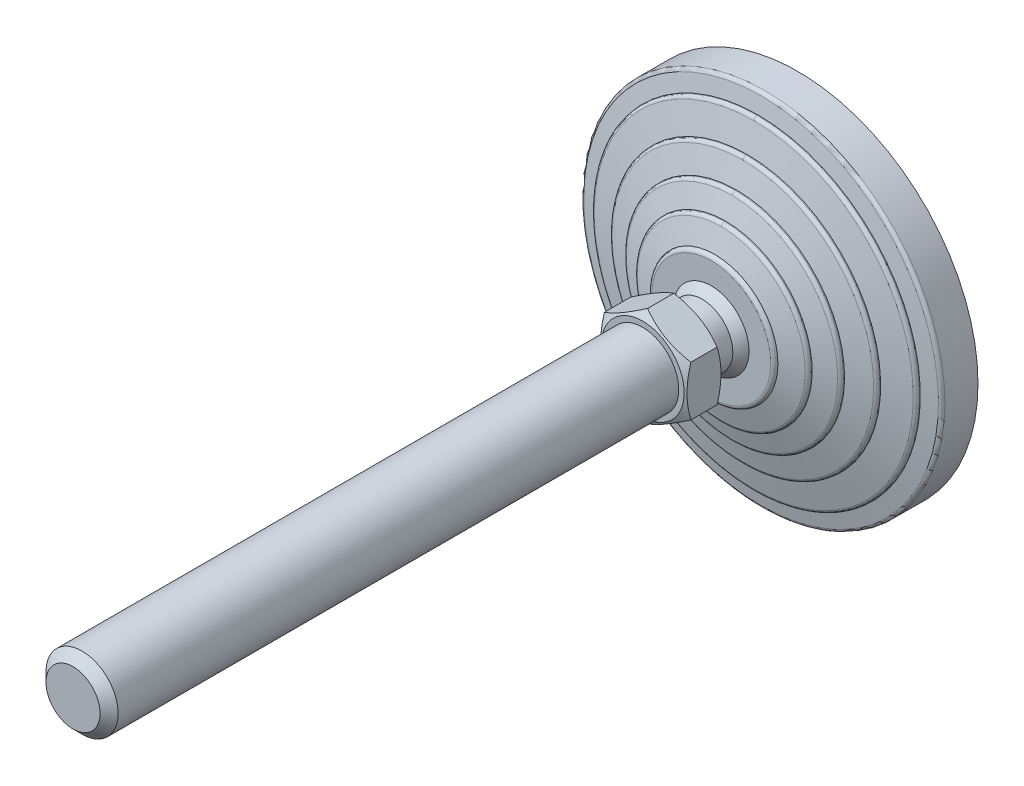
ISO-10303-21;
HEADER;
FILE_DESCRIPTION(('STEP AP214'),'2;1');
FILE_NAME('part.step','',(''),(''),'','','');
FILE_SCHEMA(('AUTOMOTIVE_DESIGN { 1 0 10303 214 1 1 1 1 }'));
ENDSEC;
DATA;
#1=APPLICATION_CONTEXT('core data for automotive mechanical design processes');
#2=APPLICATION_PROTOCOL_DEFINITION('international standard','automotive_design',2000,#1);
#3=PRODUCT_CONTEXT('',#1,'mechanical');
#4=PRODUCT('Part','Part','',(#3));
#5=PRODUCT_RELATED_PRODUCT_CATEGORY('part','',(#4));
#6=PRODUCT_DEFINITION_FORMATION('','',#4);
#7=PRODUCT_DEFINITION_CONTEXT('part definition',#1,'design');
#8=PRODUCT_DEFINITION('design','',#6,#7);
#9=PRODUCT_DEFINITION_SHAPE('','',#8);
#10=(LENGTH_UNIT() NAMED_UNIT(*) SI_UNIT(.MILLI.,.METRE.));
#11=(NAMED_UNIT(*) PLANE_ANGLE_UNIT() SI_UNIT($,.RADIAN.));
#12=(NAMED_UNIT(*) SI_UNIT($,.STERADIAN.) SOLID_ANGLE_UNIT());
#13=UNCERTAINTY_MEASURE_WITH_UNIT(LENGTH_MEASURE(1.E-05),#10,'distance_accuracy_value','');
#14=(GEOMETRIC_REPRESENTATION_CONTEXT(3) GLOBAL_UNCERTAINTY_ASSIGNED_CONTEXT((#13)) GLOBAL_UNIT_ASSIGNED_CONTEXT((#10,
#11,#12)) REPRESENTATION_CONTEXT('',''));
#15=CARTESIAN_POINT('',(0.,0.,0.));
#16=DIRECTION('',(0.,0.,1.));
#17=DIRECTION('',(1.,0.,0.));
#18=AXIS2_PLACEMENT_3D('',#15,#16,#17);
#19=CARTESIAN_POINT('',(-50.774113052,50.6,0.));
#20=DIRECTION('',(0.,0.,1.));
#21=DIRECTION('',(0.,-1.,0.));
#22=AXIS2_PLACEMENT_3D('',#19,#20,#21);
#23=PLANE('',#22);
#24=CARTESIAN_POINT('',(0.,0.,0.));
#25=DIRECTION('',(0.,0.,-1.));
#26=DIRECTION('',(1.,0.,0.));
#27=AXIS2_PLACEMENT_3D('',#24,#25,#26);
#28=CIRCLE('',#27,50.);
#29=CARTESIAN_POINT('',(50.,0.,0.));
#30=VERTEX_POINT('',#29);
#31=EDGE_CURVE('E167',#30,#30,#28,.F.);
#32=ORIENTED_EDGE('',*,*,#31,.F.);
#33=EDGE_LOOP('',(#32));
#34=FACE_BOUND('',#33,.T.);
#35=ADVANCED_FACE('F14',(#34),#23,.F.);
#36=CARTESIAN_POINT('',(0.,0.,9.180196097));
#37=DIRECTION('',(0.,0.,-1.));
#38=DIRECTION('',(1.,0.,0.));
#39=AXIS2_PLACEMENT_3D('',#36,#37,#38);
#40=CYLINDRICAL_SURFACE('',#39,50.);
#41=ORIENTED_EDGE('',*,*,#31,.T.);
#42=EDGE_LOOP('',(#41));
#43=FACE_BOUND('',#42,.T.);
#44=CARTESIAN_POINT('',(0.,0.,9.180196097));
#45=DIRECTION('',(0.,0.,1.));
#46=DIRECTION('',(0.,-1.,0.));
#47=AXIS2_PLACEMENT_3D('',#44,#45,#46);
#48=CIRCLE('',#47,50.);
#49=CARTESIAN_POINT('',(0.,-50.,9.180196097));
#50=VERTEX_POINT('',#49);
#51=EDGE_CURVE('E169',#50,#50,#48,.T.);
#52=ORIENTED_EDGE('',*,*,#51,.F.);
#53=EDGE_LOOP('',(#52));
#54=FACE_BOUND('',#53,.T.);
#55=ADVANCED_FACE('F318',(#43,#54),#40,.T.);
#56=CARTESIAN_POINT('',(0.,0.,9.18019609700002));
#57=DIRECTION('',(0.,0.,-1.));
#58=DIRECTION('',(0.,1.,0.));
#59=AXIS2_PLACEMENT_3D('',#56,#57,#58);
#60=TOROIDAL_SURFACE('',#59,48.9999999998,1.00000000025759);
#61=ORIENTED_EDGE('',*,*,#51,.T.);
#62=EDGE_LOOP('',(#61));
#63=FACE_BOUND('',#62,.T.);
#64=CARTESIAN_POINT('',(0.,0.,10.1607767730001));
#65=DIRECTION('',(0.,0.,-1.));
#66=DIRECTION('',(0.,1.,0.));
#67=AXIS2_PLACEMENT_3D('',#64,#65,#66);
#68=CIRCLE('',#67,49.196116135);
#69=CARTESIAN_POINT('',(0.,49.196116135,10.160776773));
#70=VERTEX_POINT('',#69);
#71=EDGE_CURVE('E173',#70,#70,#68,.F.);
#72=ORIENTED_EDGE('',*,*,#71,.F.);
#73=EDGE_LOOP('',(#72));
#74=FACE_BOUND('',#73,.T.);
#75=ADVANCED_FACE('F314',(#63,#74),#60,.T.);
#76=CARTESIAN_POINT('',(0.,0.,11.));
#77=DIRECTION('',(0.,0.,-1.));
#78=DIRECTION('',(0.,1.,0.));
#79=AXIS2_PLACEMENT_3D('',#76,#77,#78);
#80=CONICAL_SURFACE('',#79,45.,1.37340076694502);
#81=ORIENTED_EDGE('',*,*,#71,.T.);
#82=EDGE_LOOP('',(#81));
#83=FACE_BOUND('',#82,.T.);
#84=CARTESIAN_POINT('',(0.,0.,11.));
#85=DIRECTION('',(0.,0.,-1.));
#86=DIRECTION('',(0.,1.,0.));
#87=AXIS2_PLACEMENT_3D('',#84,#85,#86);
#88=CIRCLE('',#87,45.);
#89=CARTESIAN_POINT('',(0.,45.,11.));
#90=VERTEX_POINT('',#89);
#91=EDGE_CURVE('E464',#90,#90,#88,.F.);
#92=ORIENTED_EDGE('',*,*,#91,.F.);
#93=EDGE_LOOP('',(#92));
#94=FACE_BOUND('',#93,.T.);
#95=ADVANCED_FACE('F317',(#83,#94),#80,.T.);
#96=CARTESIAN_POINT('',(0.,0.,11.219223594));
#97=DIRECTION('',(0.,0.,-1.));
#98=DIRECTION('',(0.,1.,0.));
#99=AXIS2_PLACEMENT_3D('',#96,#97,#98);
#100=CYLINDRICAL_SURFACE('',#99,45.);
#101=ORIENTED_EDGE('',*,*,#91,.T.);
#102=EDGE_LOOP('',(#101));
#103=FACE_BOUND('',#102,.T.);
#104=CARTESIAN_POINT('',(0.,0.,11.219223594));
#105=DIRECTION('',(0.,0.,1.));
#106=DIRECTION('',(0.,-1.,0.));
#107=AXIS2_PLACEMENT_3D('',#104,#105,#106);
#108=CIRCLE('',#107,45.);
#109=CARTESIAN_POINT('',(-4.61482714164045E-09,-45.,11.219223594));
#110=VERTEX_POINT('',#109);
#111=CARTESIAN_POINT('',(0.,45.,11.219223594));
#112=VERTEX_POINT('',#111);
#113=EDGE_CURVE('E637',#110,#112,#108,.T.);
#114=ORIENTED_EDGE('',*,*,#113,.F.);
#115=CARTESIAN_POINT('',(0.,0.,11.219223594));
#116=DIRECTION('',(0.,0.,1.));
#117=DIRECTION('',(0.,-1.,0.));
#118=AXIS2_PLACEMENT_3D('',#115,#116,#117);
#119=CIRCLE('',#118,45.);
#120=EDGE_CURVE('E467',#112,#110,#119,.T.);
#121=ORIENTED_EDGE('',*,*,#120,.F.);
#122=EDGE_LOOP('',(#114,#121));
#123=FACE_BOUND('',#122,.T.);
#124=ADVANCED_FACE('F443',(#103,#123),#100,.T.);
#125=CARTESIAN_POINT('',(0.,-45.,11.219223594));
#126=CARTESIAN_POINT('',(-90.0000000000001,-45.,11.219223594));
#127=CARTESIAN_POINT('',(-90.0000000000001,45.,11.219223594));
#128=CARTESIAN_POINT('',(0.,45.,11.219223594));
#129=CARTESIAN_POINT('',(0.,-45.,11.696951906));
#130=CARTESIAN_POINT('',(-90.,-45.,11.696951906));
#131=CARTESIAN_POINT('',(-90.,45.,11.696951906));
#132=CARTESIAN_POINT('',(0.,45.,11.696951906));
#133=CARTESIAN_POINT('',(0.,-44.706000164,12.073499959));
#134=CARTESIAN_POINT('',(-89.4120003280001,-44.706000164,12.073499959));
#135=CARTESIAN_POINT('',(-89.4120003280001,44.706000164,12.073499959));
#136=CARTESIAN_POINT('',(0.,44.706000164,12.073499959));
#137=CARTESIAN_POINT('',(0.,-44.242535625,12.189366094));
#138=CARTESIAN_POINT('',(-88.4850712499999,-44.2425356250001,12.189366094));
#139=CARTESIAN_POINT('',(-88.4850712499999,44.2425356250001,12.189366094));
#140=CARTESIAN_POINT('',(0.,44.242535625,12.189366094));
#141=(BOUNDED_SURFACE() B_SPLINE_SURFACE(3,3,((#125,#126,#127,#128),(#129,#130,#131,#132),(#133,
#134,#135,#136),(#137,#138,#139,#140)),.UNSPECIFIED.,.F.,.F.,
.F.) B_SPLINE_SURFACE_WITH_KNOTS((4,4),(4,4),(0.,1.),(0.,1.),
.UNSPECIFIED.) GEOMETRIC_REPRESENTATION_ITEM() RATIONAL_B_SPLINE_SURFACE(((1.,0.333333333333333,
0.333333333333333,1.),(0.8588036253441,0.2862678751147,0.2862678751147,0.8588036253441),
(0.8588036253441,0.2862678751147,0.2862678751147,0.8588036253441),(1.,0.333333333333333,
0.333333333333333,1.))) REPRESENTATION_ITEM('') SURFACE());
#142=CARTESIAN_POINT('',(0.,45.,11.219223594));
#143=CARTESIAN_POINT('',(0.,45.,11.696951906));
#144=CARTESIAN_POINT('',(0.,44.706000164,12.073499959));
#145=CARTESIAN_POINT('',(0.,44.242535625,12.189366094));
#146=(BOUNDED_CURVE() B_SPLINE_CURVE(3,(#142,#143,#144,#145),.UNSPECIFIED.,.F.,
.F.) B_SPLINE_CURVE_WITH_KNOTS((4,4),(0.,1.),
.UNSPECIFIED.) CURVE() GEOMETRIC_REPRESENTATION_ITEM() RATIONAL_B_SPLINE_CURVE((1.,
0.8588036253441,0.8588036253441,1.)) REPRESENTATION_ITEM(''));
#147=CARTESIAN_POINT('',(0.,44.242535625,12.189366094));
#148=VERTEX_POINT('',#147);
#149=EDGE_CURVE('E628',#112,#148,#146,.T.);
#150=CARTESIAN_POINT('',(0.,-45.,11.219223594));
#151=CARTESIAN_POINT('',(0.,-45.,11.696951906));
#152=CARTESIAN_POINT('',(0.,-44.706000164,12.073499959));
#153=CARTESIAN_POINT('',(0.,-44.242535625,12.189366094));
#154=(BOUNDED_CURVE() B_SPLINE_CURVE(3,(#150,#151,#152,#153),.UNSPECIFIED.,.F.,
.F.) B_SPLINE_CURVE_WITH_KNOTS((4,4),(0.,1.),
.UNSPECIFIED.) CURVE() GEOMETRIC_REPRESENTATION_ITEM() RATIONAL_B_SPLINE_CURVE((1.,
0.8588036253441,0.8588036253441,1.)) REPRESENTATION_ITEM(''));
#155=CARTESIAN_POINT('',(-1.3611443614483E-08,-44.242535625,12.189366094));
#156=VERTEX_POINT('',#155);
#157=EDGE_CURVE('E642',#156,#110,#154,.F.);
#158=CARTESIAN_POINT('',(0.,0.,12.189366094));
#159=DIRECTION('',(0.,0.,-1.));
#160=DIRECTION('',(0.,1.,0.));
#161=AXIS2_PLACEMENT_3D('',#158,#159,#160);
#162=CIRCLE('',#161,44.242535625);
#163=EDGE_CURVE('E625',#148,#156,#162,.F.);
#164=ORIENTED_EDGE('',*,*,#149,.F.);
#165=ORIENTED_EDGE('',*,*,#120,.T.);
#166=ORIENTED_EDGE('',*,*,#157,.F.);
#167=ORIENTED_EDGE('',*,*,#163,.F.);
#168=EDGE_LOOP('',(#164,#165,#166,#167));
#169=FACE_BOUND('',#168,.T.);
#170=ADVANCED_FACE('F432',(#169),#141,.T.);
#171=CARTESIAN_POINT('',(0.,45.,11.219223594));
#172=CARTESIAN_POINT('',(90.0000000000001,45.,11.219223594));
#173=CARTESIAN_POINT('',(90.0000000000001,-45.,11.219223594));
#174=CARTESIAN_POINT('',(0.,-45.,11.219223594));
#175=CARTESIAN_POINT('',(0.,45.,11.696951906));
#176=CARTESIAN_POINT('',(90.,45.,11.696951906));
#177=CARTESIAN_POINT('',(90.,-45.,11.696951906));
#178=CARTESIAN_POINT('',(0.,-45.,11.696951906));
#179=CARTESIAN_POINT('',(0.,44.706000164,12.073499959));
#180=CARTESIAN_POINT('',(89.4120003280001,44.706000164,12.073499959));
#181=CARTESIAN_POINT('',(89.4120003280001,-44.706000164,12.073499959));
#182=CARTESIAN_POINT('',(0.,-44.706000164,12.073499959));
#183=CARTESIAN_POINT('',(0.,44.242535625,12.189366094));
#184=CARTESIAN_POINT('',(88.4850712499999,44.2425356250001,12.189366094));
#185=CARTESIAN_POINT('',(88.4850712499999,-44.2425356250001,12.189366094));
#186=CARTESIAN_POINT('',(0.,-44.242535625,12.189366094));
#187=(BOUNDED_SURFACE() B_SPLINE_SURFACE(3,3,((#171,#172,#173,#174),(#175,#176,#177,#178),(#179,
#180,#181,#182),(#183,#184,#185,#186)),.UNSPECIFIED.,.F.,.F.,
.F.) B_SPLINE_SURFACE_WITH_KNOTS((4,4),(4,4),(0.,1.),(0.,1.),
.UNSPECIFIED.) GEOMETRIC_REPRESENTATION_ITEM() RATIONAL_B_SPLINE_SURFACE(((1.,0.333333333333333,
0.333333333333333,1.),(0.8588036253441,0.2862678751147,0.2862678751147,0.8588036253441),
(0.8588036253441,0.2862678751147,0.2862678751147,0.8588036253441),(1.,0.333333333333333,
0.333333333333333,1.))) REPRESENTATION_ITEM('') SURFACE());
#188=CARTESIAN_POINT('',(0.,0.,12.189366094));
#189=DIRECTION('',(0.,0.,-1.));
#190=DIRECTION('',(0.,1.,0.));
#191=AXIS2_PLACEMENT_3D('',#188,#189,#190);
#192=CIRCLE('',#191,44.242535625);
#193=EDGE_CURVE('E624',#156,#148,#192,.F.);
#194=ORIENTED_EDGE('',*,*,#113,.T.);
#195=ORIENTED_EDGE('',*,*,#149,.T.);
#196=ORIENTED_EDGE('',*,*,#193,.F.);
#197=ORIENTED_EDGE('',*,*,#157,.T.);
#198=EDGE_LOOP('',(#194,#195,#196,#197));
#199=FACE_BOUND('',#198,.T.);
#200=ADVANCED_FACE('F426',(#199),#187,.T.);
#201=CARTESIAN_POINT('',(0.,0.,14.));
#202=DIRECTION('',(0.,0.,-1.));
#203=DIRECTION('',(1.,0.,0.));
#204=AXIS2_PLACEMENT_3D('',#201,#202,#203);
#205=CONICAL_SURFACE('',#204,37.,1.32581766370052);
#206=ORIENTED_EDGE('',*,*,#163,.T.);
#207=ORIENTED_EDGE('',*,*,#193,.T.);
#208=EDGE_LOOP('',(#206,#207));
#209=FACE_BOUND('',#208,.T.);
#210=CARTESIAN_POINT('',(0.,0.,14.));
#211=DIRECTION('',(0.,0.,-1.));
#212=DIRECTION('',(0.,1.,0.));
#213=AXIS2_PLACEMENT_3D('',#210,#211,#212);
#214=CIRCLE('',#213,37.);
#215=CARTESIAN_POINT('',(0.,37.,14.));
#216=VERTEX_POINT('',#215);
#217=EDGE_CURVE('E615',#216,#216,#214,.F.);
#218=ORIENTED_EDGE('',*,*,#217,.F.);
#219=EDGE_LOOP('',(#218));
#220=FACE_BOUND('',#219,.T.);
#221=ADVANCED_FACE('F422',(#209,#220),#205,.T.);
#222=CARTESIAN_POINT('',(0.,0.,14.245698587));
#223=DIRECTION('',(0.,0.,-1.));
#224=DIRECTION('',(1.,0.,0.));
#225=AXIS2_PLACEMENT_3D('',#222,#223,#224);
#226=CYLINDRICAL_SURFACE('',#225,37.);
#227=ORIENTED_EDGE('',*,*,#217,.T.);
#228=EDGE_LOOP('',(#227));
#229=FACE_BOUND('',#228,.T.);
#230=CARTESIAN_POINT('',(0.,0.,14.245698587));
#231=DIRECTION('',(0.,0.,1.));
#232=DIRECTION('',(0.,-1.,0.));
#233=AXIS2_PLACEMENT_3D('',#230,#231,#232);
#234=CIRCLE('',#233,37.);
#235=CARTESIAN_POINT('',(-3.79441342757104E-09,-37.,14.245698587));
#236=VERTEX_POINT('',#235);
#237=CARTESIAN_POINT('',(0.,37.,14.245698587));
#238=VERTEX_POINT('',#237);
#239=EDGE_CURVE('E595',#236,#238,#234,.T.);
#240=ORIENTED_EDGE('',*,*,#239,.F.);
#241=CARTESIAN_POINT('',(0.,0.,14.245698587));
#242=DIRECTION('',(0.,0.,1.));
#243=DIRECTION('',(0.,-1.,0.));
#244=AXIS2_PLACEMENT_3D('',#241,#242,#243);
#245=CIRCLE('',#244,37.);
#246=EDGE_CURVE('E606',#238,#236,#245,.T.);
#247=ORIENTED_EDGE('',*,*,#246,.F.);
#248=EDGE_LOOP('',(#240,#247));
#249=FACE_BOUND('',#248,.T.);
#250=ADVANCED_FACE('F413',(#229,#249),#226,.T.);
#251=CARTESIAN_POINT('',(0.,-37.,14.245698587));
#252=CARTESIAN_POINT('',(-74.,-37.,14.245698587));
#253=CARTESIAN_POINT('',(-74.,37.,14.245698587));
#254=CARTESIAN_POINT('',(0.,37.,14.245698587));
#255=CARTESIAN_POINT('',(0.,-37.,14.709515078));
#256=CARTESIAN_POINT('',(-73.9999999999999,-37.,14.709515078));
#257=CARTESIAN_POINT('',(-73.9999999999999,37.,14.709515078));
#258=CARTESIAN_POINT('',(0.,37.,14.709515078));
#259=CARTESIAN_POINT('',(0.,-36.720691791,15.079802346));
#260=CARTESIAN_POINT('',(-73.441383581,-36.720691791,15.079802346));
#261=CARTESIAN_POINT('',(-73.441383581,36.720691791,15.079802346));
#262=CARTESIAN_POINT('',(0.,36.720691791,15.079802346));
#263=CARTESIAN_POINT('',(0.,-36.274721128,15.207222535));
#264=CARTESIAN_POINT('',(-72.549442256,-36.274721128,15.207222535));
#265=CARTESIAN_POINT('',(-72.549442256,36.274721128,15.207222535));
#266=CARTESIAN_POINT('',(0.,36.274721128,15.207222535));
#267=(BOUNDED_SURFACE() B_SPLINE_SURFACE(3,3,((#251,#252,#253,#254),(#255,#256,#257,#258),(#259,
#260,#261,#262),(#263,#264,#265,#266)),.UNSPECIFIED.,.F.,.F.,
.F.) B_SPLINE_SURFACE_WITH_KNOTS((4,4),(4,4),(0.,1.),(0.,1.),
.UNSPECIFIED.) GEOMETRIC_REPRESENTATION_ITEM() RATIONAL_B_SPLINE_SURFACE(((1.,0.333333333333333,
0.333333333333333,1.),(0.865565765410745,0.288521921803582,0.288521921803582,0.865565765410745),
(0.865565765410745,0.288521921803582,0.288521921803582,0.865565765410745),(1.,0.333333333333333,
0.333333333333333,1.))) REPRESENTATION_ITEM('') SURFACE());
#268=CARTESIAN_POINT('',(0.,37.,14.245698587));
#269=CARTESIAN_POINT('',(0.,37.,14.709515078));
#270=CARTESIAN_POINT('',(0.,36.720691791,15.079802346));
#271=CARTESIAN_POINT('',(0.,36.274721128,15.207222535));
#272=(BOUNDED_CURVE() B_SPLINE_CURVE(3,(#268,#269,#270,#271),.UNSPECIFIED.,.F.,
.F.) B_SPLINE_CURVE_WITH_KNOTS((4,4),(0.,1.),
.UNSPECIFIED.) CURVE() GEOMETRIC_REPRESENTATION_ITEM() RATIONAL_B_SPLINE_CURVE((1.,
0.865565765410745,0.865565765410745,1.)) REPRESENTATION_ITEM(''));
#273=CARTESIAN_POINT('',(0.,36.274721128,15.2072225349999));
#274=VERTEX_POINT('',#273);
#275=EDGE_CURVE('E586',#238,#274,#272,.T.);
#276=CARTESIAN_POINT('',(0.,-37.,14.245698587));
#277=CARTESIAN_POINT('',(0.,-37.,14.709515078));
#278=CARTESIAN_POINT('',(0.,-36.720691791,15.079802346));
#279=CARTESIAN_POINT('',(0.,-36.274721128,15.207222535));
#280=(BOUNDED_CURVE() B_SPLINE_CURVE(3,(#276,#277,#278,#279),.UNSPECIFIED.,.F.,
.F.) B_SPLINE_CURVE_WITH_KNOTS((4,4),(0.,1.),
.UNSPECIFIED.) CURVE() GEOMETRIC_REPRESENTATION_ITEM() RATIONAL_B_SPLINE_CURVE((1.,
0.865565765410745,0.865565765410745,1.)) REPRESENTATION_ITEM(''));
#281=CARTESIAN_POINT('',(-1.11601045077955E-08,-36.274721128,15.2072225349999));
#282=VERTEX_POINT('',#281);
#283=EDGE_CURVE('E600',#282,#236,#280,.F.);
#284=CARTESIAN_POINT('',(0.,0.,15.2072225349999));
#285=DIRECTION('',(0.,0.,-1.));
#286=DIRECTION('',(0.,1.,0.));
#287=AXIS2_PLACEMENT_3D('',#284,#285,#286);
#288=CIRCLE('',#287,36.274721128);
#289=EDGE_CURVE('E583',#274,#282,#288,.F.);
#290=ORIENTED_EDGE('',*,*,#275,.F.);
#291=ORIENTED_EDGE('',*,*,#246,.T.);
#292=ORIENTED_EDGE('',*,*,#283,.F.);
#293=ORIENTED_EDGE('',*,*,#289,.F.);
#294=EDGE_LOOP('',(#290,#291,#292,#293));
#295=FACE_BOUND('',#294,.T.);
#296=ADVANCED_FACE('F402',(#295),#267,.T.);
#297=CARTESIAN_POINT('',(0.,37.,14.245698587));
#298=CARTESIAN_POINT('',(74.,37.,14.245698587));
#299=CARTESIAN_POINT('',(74.,-37.,14.245698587));
#300=CARTESIAN_POINT('',(0.,-37.,14.245698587));
#301=CARTESIAN_POINT('',(0.,37.,14.709515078));
#302=CARTESIAN_POINT('',(73.9999999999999,37.,14.709515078));
#303=CARTESIAN_POINT('',(73.9999999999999,-37.,14.709515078));
#304=CARTESIAN_POINT('',(0.,-37.,14.709515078));
#305=CARTESIAN_POINT('',(0.,36.720691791,15.079802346));
#306=CARTESIAN_POINT('',(73.441383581,36.720691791,15.079802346));
#307=CARTESIAN_POINT('',(73.441383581,-36.720691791,15.079802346));
#308=CARTESIAN_POINT('',(0.,-36.720691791,15.079802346));
#309=CARTESIAN_POINT('',(0.,36.274721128,15.207222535));
#310=CARTESIAN_POINT('',(72.549442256,36.274721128,15.207222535));
#311=CARTESIAN_POINT('',(72.549442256,-36.274721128,15.207222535));
#312=CARTESIAN_POINT('',(0.,-36.274721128,15.207222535));
#313=(BOUNDED_SURFACE() B_SPLINE_SURFACE(3,3,((#297,#298,#299,#300),(#301,#302,#303,#304),(#305,
#306,#307,#308),(#309,#310,#311,#312)),.UNSPECIFIED.,.F.,.F.,
.F.) B_SPLINE_SURFACE_WITH_KNOTS((4,4),(4,4),(0.,1.),(0.,1.),
.UNSPECIFIED.) GEOMETRIC_REPRESENTATION_ITEM() RATIONAL_B_SPLINE_SURFACE(((1.,0.333333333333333,
0.333333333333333,1.),(0.865565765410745,0.288521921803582,0.288521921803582,0.865565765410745),
(0.865565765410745,0.288521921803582,0.288521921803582,0.865565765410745),(1.,0.333333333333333,
0.333333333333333,1.))) REPRESENTATION_ITEM('') SURFACE());
#314=CARTESIAN_POINT('',(0.,0.,15.2072225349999));
#315=DIRECTION('',(0.,0.,-1.));
#316=DIRECTION('',(0.,1.,0.));
#317=AXIS2_PLACEMENT_3D('',#314,#315,#316);
#318=CIRCLE('',#317,36.274721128);
#319=EDGE_CURVE('E582',#282,#274,#318,.F.);
#320=ORIENTED_EDGE('',*,*,#239,.T.);
#321=ORIENTED_EDGE('',*,*,#275,.T.);
#322=ORIENTED_EDGE('',*,*,#319,.F.);
#323=ORIENTED_EDGE('',*,*,#283,.T.);
#324=EDGE_LOOP('',(#320,#321,#322,#323));
#325=FACE_BOUND('',#324,.T.);
#326=ADVANCED_FACE('F396',(#325),#313,.T.);
#327=CARTESIAN_POINT('',(0.,0.,17.));
#328=DIRECTION('',(0.,0.,-1.));
#329=DIRECTION('',(0.,1.,0.));
#330=AXIS2_PLACEMENT_3D('',#327,#328,#329);
#331=CONICAL_SURFACE('',#330,30.,1.29249666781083);
#332=ORIENTED_EDGE('',*,*,#289,.T.);
#333=ORIENTED_EDGE('',*,*,#319,.T.);
#334=EDGE_LOOP('',(#332,#333));
#335=FACE_BOUND('',#334,.T.);
#336=CARTESIAN_POINT('',(0.,0.,17.));
#337=DIRECTION('',(0.,0.,-1.));
#338=DIRECTION('',(0.,1.,0.));
#339=AXIS2_PLACEMENT_3D('',#336,#337,#338);
#340=CIRCLE('',#339,30.);
#341=CARTESIAN_POINT('',(0.,30.,17.));
#342=VERTEX_POINT('',#341);
#343=EDGE_CURVE('E573',#342,#342,#340,.F.);
#344=ORIENTED_EDGE('',*,*,#343,.F.);
#345=EDGE_LOOP('',(#344));
#346=FACE_BOUND('',#345,.T.);
#347=ADVANCED_FACE('F392',(#335,#346),#331,.T.);
#348=CARTESIAN_POINT('',(0.,0.,17.27924078));
#349=DIRECTION('',(0.,0.,-1.));
#350=DIRECTION('',(0.,1.,0.));
#351=AXIS2_PLACEMENT_3D('',#348,#349,#350);
#352=CYLINDRICAL_SURFACE('',#351,30.);
#353=ORIENTED_EDGE('',*,*,#343,.T.);
#354=EDGE_LOOP('',(#353));
#355=FACE_BOUND('',#354,.T.);
#356=CARTESIAN_POINT('',(0.,0.,17.27924078));
#357=DIRECTION('',(0.,0.,1.));
#358=DIRECTION('',(0.,-1.,0.));
#359=AXIS2_PLACEMENT_3D('',#356,#357,#358);
#360=CIRCLE('',#359,30.);
#361=CARTESIAN_POINT('',(-3.0765514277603E-09,-30.,17.27924078));
#362=VERTEX_POINT('',#361);
#363=CARTESIAN_POINT('',(0.,30.,17.27924078));
#364=VERTEX_POINT('',#363);
#365=EDGE_CURVE('E553',#362,#364,#360,.T.);
#366=ORIENTED_EDGE('',*,*,#365,.F.);
#367=CARTESIAN_POINT('',(0.,0.,17.27924078));
#368=DIRECTION('',(0.,0.,1.));
#369=DIRECTION('',(0.,-1.,0.));
#370=AXIS2_PLACEMENT_3D('',#367,#368,#369);
#371=CIRCLE('',#370,30.);
#372=EDGE_CURVE('E564',#364,#362,#371,.T.);
#373=ORIENTED_EDGE('',*,*,#372,.F.);
#374=EDGE_LOOP('',(#366,#373));
#375=FACE_BOUND('',#374,.T.);
#376=ADVANCED_FACE('F383',(#355,#375),#352,.T.);
#377=CARTESIAN_POINT('',(0.,-30.,17.27924078));
#378=CARTESIAN_POINT('',(-60.0000000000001,-30.,17.27924078));
#379=CARTESIAN_POINT('',(-60.0000000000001,30.,17.27924078));
#380=CARTESIAN_POINT('',(0.,30.,17.27924078));
#381=CARTESIAN_POINT('',(0.,-30.,17.725161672));
#382=CARTESIAN_POINT('',(-60.,-30.,17.725161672));
#383=CARTESIAN_POINT('',(-60.,30.,17.725161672));
#384=CARTESIAN_POINT('',(0.,30.,17.725161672));
#385=CARTESIAN_POINT('',(0.,-29.739265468,18.086911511));
#386=CARTESIAN_POINT('',(-59.478530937,-29.739265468,18.086911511));
#387=CARTESIAN_POINT('',(-59.478530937,29.739265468,18.086911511));
#388=CARTESIAN_POINT('',(0.,29.739265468,18.086911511));
#389=CARTESIAN_POINT('',(0.,-29.316227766,18.227924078));
#390=CARTESIAN_POINT('',(-58.6324555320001,-29.316227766,18.227924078));
#391=CARTESIAN_POINT('',(-58.6324555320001,29.316227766,18.227924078));
#392=CARTESIAN_POINT('',(0.,29.316227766,18.227924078));
#393=(BOUNDED_SURFACE() B_SPLINE_SURFACE(3,3,((#377,#378,#379,#380),(#381,#382,#383,#384),(#385,
#386,#387,#388),(#389,#390,#391,#392)),.UNSPECIFIED.,.F.,.F.,
.F.) B_SPLINE_SURFACE_WITH_KNOTS((4,4),(4,4),(0.,1.),(0.,1.),
.UNSPECIFIED.) GEOMETRIC_REPRESENTATION_ITEM() RATIONAL_B_SPLINE_SURFACE(((1.,0.333333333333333,
0.333333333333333,1.),(0.874161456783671,0.291387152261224,0.291387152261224,0.874161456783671),
(0.874161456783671,0.291387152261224,0.291387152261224,0.874161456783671),(1.,0.333333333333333,
0.333333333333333,1.))) REPRESENTATION_ITEM('') SURFACE());
#394=CARTESIAN_POINT('',(0.,30.,17.27924078));
#395=CARTESIAN_POINT('',(0.,30.,17.725161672));
#396=CARTESIAN_POINT('',(0.,29.739265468,18.086911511));
#397=CARTESIAN_POINT('',(0.,29.316227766,18.227924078));
#398=(BOUNDED_CURVE() B_SPLINE_CURVE(3,(#394,#395,#396,#397),.UNSPECIFIED.,.F.,
.F.) B_SPLINE_CURVE_WITH_KNOTS((4,4),(0.,1.),
.UNSPECIFIED.) CURVE() GEOMETRIC_REPRESENTATION_ITEM() RATIONAL_B_SPLINE_CURVE((1.,
0.874161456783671,0.874161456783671,1.)) REPRESENTATION_ITEM(''));
#399=CARTESIAN_POINT('',(0.,29.3162277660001,18.2279240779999));
#400=VERTEX_POINT('',#399);
#401=EDGE_CURVE('E544',#364,#400,#398,.T.);
#402=CARTESIAN_POINT('',(0.,-30.,17.27924078));
#403=CARTESIAN_POINT('',(0.,-30.,17.725161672));
#404=CARTESIAN_POINT('',(0.,-29.739265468,18.086911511));
#405=CARTESIAN_POINT('',(0.,-29.316227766,18.227924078));
#406=(BOUNDED_CURVE() B_SPLINE_CURVE(3,(#402,#403,#404,#405),.UNSPECIFIED.,.F.,
.F.) B_SPLINE_CURVE_WITH_KNOTS((4,4),(0.,1.),
.UNSPECIFIED.) CURVE() GEOMETRIC_REPRESENTATION_ITEM() RATIONAL_B_SPLINE_CURVE((1.,
0.874161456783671,0.874161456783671,1.)) REPRESENTATION_ITEM(''));
#407=CARTESIAN_POINT('',(-9.01928823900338E-09,-29.3162277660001,18.2279240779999));
#408=VERTEX_POINT('',#407);
#409=EDGE_CURVE('E558',#408,#362,#406,.F.);
#410=CARTESIAN_POINT('',(0.,0.,18.2279240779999));
#411=DIRECTION('',(0.,0.,-1.));
#412=DIRECTION('',(0.,1.,0.));
#413=AXIS2_PLACEMENT_3D('',#410,#411,#412);
#414=CIRCLE('',#413,29.316227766);
#415=EDGE_CURVE('E541',#400,#408,#414,.F.);
#416=ORIENTED_EDGE('',*,*,#401,.F.);
#417=ORIENTED_EDGE('',*,*,#372,.T.);
#418=ORIENTED_EDGE('',*,*,#409,.F.);
#419=ORIENTED_EDGE('',*,*,#415,.F.);
#420=EDGE_LOOP('',(#416,#417,#418,#419));
#421=FACE_BOUND('',#420,.T.);
#422=ADVANCED_FACE('F372',(#421),#393,.T.);
#423=CARTESIAN_POINT('',(0.,30.,17.27924078));
#424=CARTESIAN_POINT('',(60.0000000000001,30.,17.27924078));
#425=CARTESIAN_POINT('',(60.0000000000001,-30.,17.27924078));
#426=CARTESIAN_POINT('',(0.,-30.,17.27924078));
#427=CARTESIAN_POINT('',(0.,30.,17.725161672));
#428=CARTESIAN_POINT('',(60.,30.,17.725161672));
#429=CARTESIAN_POINT('',(60.,-30.,17.725161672));
#430=CARTESIAN_POINT('',(0.,-30.,17.725161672));
#431=CARTESIAN_POINT('',(0.,29.739265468,18.086911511));
#432=CARTESIAN_POINT('',(59.478530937,29.739265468,18.086911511));
#433=CARTESIAN_POINT('',(59.478530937,-29.739265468,18.086911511));
#434=CARTESIAN_POINT('',(0.,-29.739265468,18.086911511));
#435=CARTESIAN_POINT('',(0.,29.316227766,18.227924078));
#436=CARTESIAN_POINT('',(58.6324555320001,29.316227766,18.227924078));
#437=CARTESIAN_POINT('',(58.6324555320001,-29.316227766,18.227924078));
#438=CARTESIAN_POINT('',(0.,-29.316227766,18.227924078));
#439=(BOUNDED_SURFACE() B_SPLINE_SURFACE(3,3,((#423,#424,#425,#426),(#427,#428,#429,#430),(#431,
#432,#433,#434),(#435,#436,#437,#438)),.UNSPECIFIED.,.F.,.F.,
.F.) B_SPLINE_SURFACE_WITH_KNOTS((4,4),(4,4),(0.,1.),(0.,1.),
.UNSPECIFIED.) GEOMETRIC_REPRESENTATION_ITEM() RATIONAL_B_SPLINE_SURFACE(((1.,0.333333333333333,
0.333333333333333,1.),(0.874161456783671,0.291387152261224,0.291387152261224,0.874161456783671),
(0.874161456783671,0.291387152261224,0.291387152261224,0.874161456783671),(1.,0.333333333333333,
0.333333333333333,1.))) REPRESENTATION_ITEM('') SURFACE());
#440=CARTESIAN_POINT('',(0.,0.,18.2279240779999));
#441=DIRECTION('',(0.,0.,-1.));
#442=DIRECTION('',(0.,1.,0.));
#443=AXIS2_PLACEMENT_3D('',#440,#441,#442);
#444=CIRCLE('',#443,29.316227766);
#445=EDGE_CURVE('E540',#408,#400,#444,.F.);
#446=ORIENTED_EDGE('',*,*,#365,.T.);
#447=ORIENTED_EDGE('',*,*,#401,.T.);
#448=ORIENTED_EDGE('',*,*,#445,.F.);
#449=ORIENTED_EDGE('',*,*,#409,.T.);
#450=EDGE_LOOP('',(#446,#447,#448,#449));
#451=FACE_BOUND('',#450,.T.);
#452=ADVANCED_FACE('F366',(#451),#439,.T.);
#453=CARTESIAN_POINT('',(0.,0.,20.));
#454=DIRECTION('',(0.,0.,-1.));
#455=DIRECTION('',(1.,0.,0.));
#456=AXIS2_PLACEMENT_3D('',#453,#454,#455);
#457=CONICAL_SURFACE('',#456,24.,1.24904577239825);
#458=ORIENTED_EDGE('',*,*,#415,.T.);
#459=ORIENTED_EDGE('',*,*,#445,.T.);
#460=EDGE_LOOP('',(#458,#459));
#461=FACE_BOUND('',#460,.T.);
#462=CARTESIAN_POINT('',(0.,0.,20.));
#463=DIRECTION('',(0.,0.,-1.));
#464=DIRECTION('',(0.,1.,0.));
#465=AXIS2_PLACEMENT_3D('',#462,#463,#464);
#466=CIRCLE('',#465,24.);
#467=CARTESIAN_POINT('',(0.,24.,20.));
#468=VERTEX_POINT('',#467);
#469=EDGE_CURVE('E531',#468,#468,#466,.F.);
#470=ORIENTED_EDGE('',*,*,#469,.F.);
#471=EDGE_LOOP('',(#470));
#472=FACE_BOUND('',#471,.T.);
#473=ADVANCED_FACE('F362',(#461,#472),#457,.T.);
#474=CARTESIAN_POINT('',(0.,0.,20.261425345));
#475=DIRECTION('',(0.,0.,-1.));
#476=DIRECTION('',(0.,1.,0.));
#477=AXIS2_PLACEMENT_3D('',#474,#475,#476);
#478=CYLINDRICAL_SURFACE('',#477,24.);
#479=ORIENTED_EDGE('',*,*,#469,.T.);
#480=EDGE_LOOP('',(#479));
#481=FACE_BOUND('',#480,.T.);
#482=CARTESIAN_POINT('',(0.,0.,20.261425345));
#483=DIRECTION('',(0.,0.,1.));
#484=DIRECTION('',(0.,-1.,0.));
#485=AXIS2_PLACEMENT_3D('',#482,#483,#484);
#486=CIRCLE('',#485,24.);
#487=CARTESIAN_POINT('',(-2.46124114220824E-09,-24.,20.261425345));
#488=VERTEX_POINT('',#487);
#489=CARTESIAN_POINT('',(0.,24.,20.261425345));
#490=VERTEX_POINT('',#489);
#491=EDGE_CURVE('E511',#488,#490,#486,.T.);
#492=ORIENTED_EDGE('',*,*,#491,.F.);
#493=CARTESIAN_POINT('',(0.,0.,20.261425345));
#494=DIRECTION('',(0.,0.,1.));
#495=DIRECTION('',(0.,-1.,0.));
#496=AXIS2_PLACEMENT_3D('',#493,#494,#495);
#497=CIRCLE('',#496,24.);
#498=EDGE_CURVE('E522',#490,#488,#497,.T.);
#499=ORIENTED_EDGE('',*,*,#498,.F.);
#500=EDGE_LOOP('',(#492,#499));
#501=FACE_BOUND('',#500,.T.);
#502=ADVANCED_FACE('F353',(#481,#501),#478,.T.);
#503=CARTESIAN_POINT('',(0.,-24.,20.261425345));
#504=CARTESIAN_POINT('',(-48.,-24.,20.261425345));
#505=CARTESIAN_POINT('',(-48.,24.,20.261425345));
#506=CARTESIAN_POINT('',(0.,24.,20.261425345));
#507=CARTESIAN_POINT('',(0.,-24.,20.716888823));
#508=CARTESIAN_POINT('',(-48.,-24.,20.716888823));
#509=CARTESIAN_POINT('',(-48.,24.,20.716888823));
#510=CARTESIAN_POINT('',(0.,24.,20.716888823));
#511=CARTESIAN_POINT('',(0.,-23.72940828,21.083258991));
#512=CARTESIAN_POINT('',(-47.458816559,-23.72940828,21.083258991));
#513=CARTESIAN_POINT('',(-47.458816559,23.72940828,21.083258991));
#514=CARTESIAN_POINT('',(0.,23.72940828,21.083258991));
#515=CARTESIAN_POINT('',(0.,-23.294085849,21.217204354));
#516=CARTESIAN_POINT('',(-46.5881716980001,-23.294085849,21.217204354));
#517=CARTESIAN_POINT('',(-46.5881716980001,23.294085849,21.217204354));
#518=CARTESIAN_POINT('',(0.,23.294085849,21.217204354));
#519=(BOUNDED_SURFACE() B_SPLINE_SURFACE(3,3,((#503,#504,#505,#506),(#507,#508,#509,#510),(#511,
#512,#513,#514),(#515,#516,#517,#518)),.UNSPECIFIED.,.F.,.F.,
.F.) B_SPLINE_SURFACE_WITH_KNOTS((4,4),(4,4),(0.,1.),(0.,1.),
.UNSPECIFIED.) GEOMETRIC_REPRESENTATION_ITEM() RATIONAL_B_SPLINE_SURFACE(((1.,0.333333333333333,
0.333333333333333,1.),(0.869593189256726,0.289864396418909,0.289864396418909,0.869593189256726),
(0.869593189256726,0.289864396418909,0.289864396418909,0.869593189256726),(1.,0.333333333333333,
0.333333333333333,1.))) REPRESENTATION_ITEM('') SURFACE());
#520=CARTESIAN_POINT('',(0.,24.,20.261425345));
#521=CARTESIAN_POINT('',(0.,24.,20.716888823));
#522=CARTESIAN_POINT('',(0.,23.72940828,21.083258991));
#523=CARTESIAN_POINT('',(0.,23.294085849,21.217204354));
#524=(BOUNDED_CURVE() B_SPLINE_CURVE(3,(#520,#521,#522,#523),.UNSPECIFIED.,.F.,
.F.) B_SPLINE_CURVE_WITH_KNOTS((4,4),(0.,1.),
.UNSPECIFIED.) CURVE() GEOMETRIC_REPRESENTATION_ITEM() RATIONAL_B_SPLINE_CURVE((1.,
0.869593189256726,0.869593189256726,1.)) REPRESENTATION_ITEM(''));
#525=CARTESIAN_POINT('',(0.,23.294085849,21.217204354));
#526=VERTEX_POINT('',#525);
#527=EDGE_CURVE('E502',#490,#526,#524,.T.);
#528=CARTESIAN_POINT('',(0.,-24.,20.261425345));
#529=CARTESIAN_POINT('',(0.,-24.,20.716888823));
#530=CARTESIAN_POINT('',(0.,-23.72940828,21.083258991));
#531=CARTESIAN_POINT('',(0.,-23.294085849,21.217204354));
#532=(BOUNDED_CURVE() B_SPLINE_CURVE(3,(#528,#529,#530,#531),.UNSPECIFIED.,.F.,
.F.) B_SPLINE_CURVE_WITH_KNOTS((4,4),(0.,1.),
.UNSPECIFIED.) CURVE() GEOMETRIC_REPRESENTATION_ITEM() RATIONAL_B_SPLINE_CURVE((1.,
0.869593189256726,0.869593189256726,1.)) REPRESENTATION_ITEM(''));
#533=CARTESIAN_POINT('',(-7.1665453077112E-09,-23.294085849,21.217204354));
#534=VERTEX_POINT('',#533);
#535=EDGE_CURVE('E516',#534,#488,#532,.F.);
#536=CARTESIAN_POINT('',(0.,0.,21.217204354));
#537=DIRECTION('',(0.,0.,-1.));
#538=DIRECTION('',(0.,1.,0.));
#539=AXIS2_PLACEMENT_3D('',#536,#537,#538);
#540=CIRCLE('',#539,23.294085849);
#541=EDGE_CURVE('E499',#526,#534,#540,.F.);
#542=ORIENTED_EDGE('',*,*,#527,.F.);
#543=ORIENTED_EDGE('',*,*,#498,.T.);
#544=ORIENTED_EDGE('',*,*,#535,.F.);
#545=ORIENTED_EDGE('',*,*,#541,.F.);
#546=EDGE_LOOP('',(#542,#543,#544,#545));
#547=FACE_BOUND('',#546,.T.);
#548=ADVANCED_FACE('F342',(#547),#519,.T.);
#549=CARTESIAN_POINT('',(0.,24.,20.261425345));
#550=CARTESIAN_POINT('',(48.,24.,20.261425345));
#551=CARTESIAN_POINT('',(48.,-24.,20.261425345));
#552=CARTESIAN_POINT('',(0.,-24.,20.261425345));
#553=CARTESIAN_POINT('',(0.,24.,20.716888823));
#554=CARTESIAN_POINT('',(48.,24.,20.716888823));
#555=CARTESIAN_POINT('',(48.,-24.,20.716888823));
#556=CARTESIAN_POINT('',(0.,-24.,20.716888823));
#557=CARTESIAN_POINT('',(0.,23.72940828,21.083258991));
#558=CARTESIAN_POINT('',(47.458816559,23.72940828,21.083258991));
#559=CARTESIAN_POINT('',(47.458816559,-23.72940828,21.083258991));
#560=CARTESIAN_POINT('',(0.,-23.72940828,21.083258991));
#561=CARTESIAN_POINT('',(0.,23.294085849,21.217204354));
#562=CARTESIAN_POINT('',(46.5881716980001,23.294085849,21.217204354));
#563=CARTESIAN_POINT('',(46.5881716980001,-23.294085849,21.217204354));
#564=CARTESIAN_POINT('',(0.,-23.294085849,21.217204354));
#565=(BOUNDED_SURFACE() B_SPLINE_SURFACE(3,3,((#549,#550,#551,#552),(#553,#554,#555,#556),(#557,
#558,#559,#560),(#561,#562,#563,#564)),.UNSPECIFIED.,.F.,.F.,
.F.) B_SPLINE_SURFACE_WITH_KNOTS((4,4),(4,4),(0.,1.),(0.,1.),
.UNSPECIFIED.) GEOMETRIC_REPRESENTATION_ITEM() RATIONAL_B_SPLINE_SURFACE(((1.,0.333333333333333,
0.333333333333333,1.),(0.869593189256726,0.289864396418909,0.289864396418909,0.869593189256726),
(0.869593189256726,0.289864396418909,0.289864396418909,0.869593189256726),(1.,0.333333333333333,
0.333333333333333,1.))) REPRESENTATION_ITEM('') SURFACE());
#566=CARTESIAN_POINT('',(0.,0.,21.217204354));
#567=DIRECTION('',(0.,0.,-1.));
#568=DIRECTION('',(0.,1.,0.));
#569=AXIS2_PLACEMENT_3D('',#566,#567,#568);
#570=CIRCLE('',#569,23.294085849);
#571=EDGE_CURVE('E498',#534,#526,#570,.F.);
#572=ORIENTED_EDGE('',*,*,#491,.T.);
#573=ORIENTED_EDGE('',*,*,#527,.T.);
#574=ORIENTED_EDGE('',*,*,#571,.F.);
#575=ORIENTED_EDGE('',*,*,#535,.T.);
#576=EDGE_LOOP('',(#572,#573,#574,#575));
#577=FACE_BOUND('',#576,.T.);
#578=ADVANCED_FACE('F336',(#577),#565,.T.);
#579=CARTESIAN_POINT('',(0.,0.,23.));
#580=DIRECTION('',(0.,0.,-1.));
#581=DIRECTION('',(0.,1.,0.));
#582=AXIS2_PLACEMENT_3D('',#579,#580,#581);
#583=CONICAL_SURFACE('',#582,17.5,1.27229739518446);
#584=ORIENTED_EDGE('',*,*,#541,.T.);
#585=ORIENTED_EDGE('',*,*,#571,.T.);
#586=EDGE_LOOP('',(#584,#585));
#587=FACE_BOUND('',#586,.T.);
#588=CARTESIAN_POINT('',(0.,0.,23.));
#589=DIRECTION('',(0.,0.,1.));
#590=DIRECTION('',(0.,-1.,0.));
#591=AXIS2_PLACEMENT_3D('',#588,#589,#590);
#592=CIRCLE('',#591,17.5);
#593=CARTESIAN_POINT('',(0.,-17.5,23.));
#594=VERTEX_POINT('',#593);
#595=EDGE_CURVE('E166',#594,#594,#592,.T.);
#596=ORIENTED_EDGE('',*,*,#595,.F.);
#597=EDGE_LOOP('',(#596));
#598=FACE_BOUND('',#597,.T.);
#599=ADVANCED_FACE('F312',(#587,#598),#583,.T.);
#600=CARTESIAN_POINT('',(0.,0.,23.));
#601=DIRECTION('',(0.,0.,-1.));
#602=DIRECTION('',(0.,1.,0.));
#603=AXIS2_PLACEMENT_3D('',#600,#601,#602);
#604=TOROIDAL_SURFACE('',#603,16.5,1.);
#605=ORIENTED_EDGE('',*,*,#595,.T.);
#606=EDGE_LOOP('',(#605));
#607=FACE_BOUND('',#606,.T.);
#608=CARTESIAN_POINT('',(0.,0.,24.));
#609=DIRECTION('',(0.,0.,-1.));
#610=DIRECTION('',(0.,1.,0.));
#611=AXIS2_PLACEMENT_3D('',#608,#609,#610);
#612=CIRCLE('',#611,16.499999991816);
#613=CARTESIAN_POINT('',(0.,16.499999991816,24.));
#614=VERTEX_POINT('',#613);
#615=EDGE_CURVE('E164',#614,#614,#612,.T.);
#616=ORIENTED_EDGE('',*,*,#615,.T.);
#617=EDGE_LOOP('',(#616));
#618=FACE_BOUND('',#617,.T.);
#619=ADVANCED_FACE('F308',(#607,#618),#604,.T.);
#620=CARTESIAN_POINT('',(-16.755457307,-16.698,24.));
#621=DIRECTION('',(0.,0.,-1.));
#622=DIRECTION('',(0.,1.,0.));
#623=AXIS2_PLACEMENT_3D('',#620,#621,#622);
#624=PLANE('',#623);
#625=CARTESIAN_POINT('',(0.,0.,24.));
#626=DIRECTION('',(0.,0.,-1.));
#627=DIRECTION('',(0.,1.,0.));
#628=AXIS2_PLACEMENT_3D('',#625,#626,#627);
#629=CIRCLE('',#628,10.4879440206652);
#630=CARTESIAN_POINT('',(0.,10.4879440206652,24.));
#631=VERTEX_POINT('',#630);
#632=EDGE_CURVE('E161',#631,#631,#629,.F.);
#633=ORIENTED_EDGE('',*,*,#632,.F.);
#634=EDGE_LOOP('',(#633));
#635=FACE_BOUND('',#634,.T.);
#636=ORIENTED_EDGE('',*,*,#615,.F.);
#637=EDGE_LOOP('',(#636));
#638=FACE_BOUND('',#637,.T.);
#639=ADVANCED_FACE('F305',(#635,#638),#624,.F.);
#640=CARTESIAN_POINT('',(0.,0.,17.670266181));
#641=DIRECTION('',(0.,0.,-1.));
#642=DIRECTION('',(1.,0.,0.));
#643=AXIS2_PLACEMENT_3D('',#640,#641,#642);
#644=SPHERICAL_SURFACE('',#643,12.25);
#645=ORIENTED_EDGE('',*,*,#632,.T.);
#646=EDGE_LOOP('',(#645));
#647=FACE_BOUND('',#646,.T.);
#648=CARTESIAN_POINT('',(0.,0.,26.5));
#649=DIRECTION('',(0.,0.,-1.));
#650=DIRECTION('',(0.,1.,0.));
#651=AXIS2_PLACEMENT_3D('',#648,#649,#650);
#652=CIRCLE('',#651,8.49107182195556);
#653=CARTESIAN_POINT('',(0.,8.49107182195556,26.5));
#654=VERTEX_POINT('',#653);
#655=EDGE_CURVE('E158',#654,#654,#652,.T.);
#656=ORIENTED_EDGE('',*,*,#655,.T.);
#657=EDGE_LOOP('',(#656));
#658=FACE_BOUND('',#657,.T.);
#659=ADVANCED_FACE('F303',(#647,#658),#644,.T.);
#660=CARTESIAN_POINT('',(-8.631599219,8.622532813,26.5));
#661=DIRECTION('',(0.,0.,1.));
#662=DIRECTION('',(0.,-1.,0.));
#663=AXIS2_PLACEMENT_3D('',#660,#661,#662);
#664=PLANE('',#663);
#665=ORIENTED_EDGE('',*,*,#655,.F.);
#666=EDGE_LOOP('',(#665));
#667=FACE_BOUND('',#666,.T.);
#668=CARTESIAN_POINT('',(0.,0.,26.5));
#669=DIRECTION('',(0.,0.,-1.));
#670=DIRECTION('',(0.,1.,0.));
#671=AXIS2_PLACEMENT_3D('',#668,#669,#670);
#672=CIRCLE('',#671,8.5);
#673=CARTESIAN_POINT('',(0.,8.5,26.5));
#674=VERTEX_POINT('',#673);
#675=EDGE_CURVE('E155',#674,#674,#672,.F.);
#676=ORIENTED_EDGE('',*,*,#675,.F.);
#677=EDGE_LOOP('',(#676));
#678=FACE_BOUND('',#677,.T.);
#679=ADVANCED_FACE('F295',(#667,#678),#664,.F.);
#680=CARTESIAN_POINT('',(0.,0.,33.));
#681=DIRECTION('',(0.,0.,-1.));
#682=DIRECTION('',(0.,1.,0.));
#683=AXIS2_PLACEMENT_3D('',#680,#681,#682);
#684=CYLINDRICAL_SURFACE('',#683,8.5);
#685=ORIENTED_EDGE('',*,*,#675,.T.);
#686=EDGE_LOOP('',(#685));
#687=FACE_BOUND('',#686,.T.);
#688=CARTESIAN_POINT('',(0.,0.,33.));
#689=DIRECTION('',(0.,0.,-1.));
#690=DIRECTION('',(0.,1.,0.));
#691=AXIS2_PLACEMENT_3D('',#688,#689,#690);
#692=CIRCLE('',#691,8.5);
#693=CARTESIAN_POINT('',(0.,8.5,33.));
#694=VERTEX_POINT('',#693);
#695=EDGE_CURVE('E152',#694,#694,#692,.T.);
#696=ORIENTED_EDGE('',*,*,#695,.T.);
#697=EDGE_LOOP('',(#696));
#698=FACE_BOUND('',#697,.T.);
#699=ADVANCED_FACE('F289',(#687,#698),#684,.T.);
#700=CARTESIAN_POINT('',(-12.,14.022683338,33.));
#701=DIRECTION('',(0.,0.,1.));
#702=DIRECTION('',(0.,-1.,0.));
#703=AXIS2_PLACEMENT_3D('',#700,#701,#702);
#704=PLANE('',#703);
#705=CARTESIAN_POINT('',(0.,0.,33.));
#706=DIRECTION('',(0.,0.,-1.));
#707=DIRECTION('',(-1.,0.,0.));
#708=AXIS2_PLACEMENT_3D('',#705,#706,#707);
#709=CIRCLE('',#708,11.5);
#710=CARTESIAN_POINT('',(-11.5,0.,33.));
#711=VERTEX_POINT('',#710);
#712=EDGE_CURVE('E484',#711,#711,#709,.T.);
#713=ORIENTED_EDGE('',*,*,#712,.T.);
#714=EDGE_LOOP('',(#713));
#715=FACE_BOUND('',#714,.T.);
#716=ORIENTED_EDGE('',*,*,#695,.F.);
#717=EDGE_LOOP('',(#716));
#718=FACE_BOUND('',#717,.T.);
#719=ADVANCED_FACE('F220',(#715,#718),#704,.F.);
#720=CARTESIAN_POINT('',(0.,0.,36.5146925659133));
#721=DIRECTION('',(0.,0.,1.));
#722=DIRECTION('',(1.,0.,0.));
#723=AXIS2_PLACEMENT_3D('',#720,#721,#722);
#724=CONICAL_SURFACE('',#723,17.5876260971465,1.0471975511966);
#725=CARTESIAN_POINT('',(-12.,-18.6346350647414,39.1569508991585));
#726=CARTESIAN_POINT('',(-12.,-18.3724796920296,39.0297004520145));
#727=CARTESIAN_POINT('',(-12.,-18.1100173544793,38.9030826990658));
#728=CARTESIAN_POINT('',(-12.,-17.5844146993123,38.651255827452));
#729=CARTESIAN_POINT('',(-12.,-17.3212743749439,38.5260467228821));
#730=CARTESIAN_POINT('',(-12.,-16.5306706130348,38.1527144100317));
#731=CARTESIAN_POINT('',(-12.,-16.0021015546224,37.9069237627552));
#732=CARTESIAN_POINT('',(-12.,-14.9385698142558,37.4217262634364));
#733=CARTESIAN_POINT('',(-12.,-14.403588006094,37.182361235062));
#734=CARTESIAN_POINT('',(-12.,-13.3293784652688,36.7133901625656));
#735=CARTESIAN_POINT('',(-12.,-12.7901509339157,36.4837836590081));
#736=CARTESIAN_POINT('',(-12.,-11.6890992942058,36.0296969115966));
#737=CARTESIAN_POINT('',(-12.,-11.127107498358,35.8056211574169));
#738=CARTESIAN_POINT('',(-12.,-9.99655413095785,35.3743681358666));
#739=CARTESIAN_POINT('',(-12.,-9.42799183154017,35.1671927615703));
#740=CARTESIAN_POINT('',(-12.,-8.28446760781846,34.7751642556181));
#741=CARTESIAN_POINT('',(-12.,-7.70952122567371,34.5902661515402));
#742=CARTESIAN_POINT('',(-12.,-6.55132669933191,34.2486984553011));
#743=CARTESIAN_POINT('',(-12.,-5.96808122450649,34.0920199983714));
#744=CARTESIAN_POINT('',(-12.,-5.08849697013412,33.8842524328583));
#745=CARTESIAN_POINT('',(-12.,-4.79532440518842,33.8196780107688));
#746=CARTESIAN_POINT('',(-12.,-4.20697144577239,33.7003798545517));
#747=CARTESIAN_POINT('',(-12.,-3.91179109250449,33.6456559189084));
#748=CARTESIAN_POINT('',(-12.,-3.31962424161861,33.5470231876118));
#749=CARTESIAN_POINT('',(-12.,-3.02263777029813,33.5031142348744));
#750=CARTESIAN_POINT('',(-12.,-2.4271714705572,33.4269864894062));
#751=CARTESIAN_POINT('',(-12.,-2.12869170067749,33.3947672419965));
#752=CARTESIAN_POINT('',(-12.,-1.53456423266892,33.3430643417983));
#753=CARTESIAN_POINT('',(-12.,-1.23893065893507,33.3234193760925));
#754=CARTESIAN_POINT('',(-12.,-0.647098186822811,33.29665036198));
#755=CARTESIAN_POINT('',(-12.,-0.350899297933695,33.2895261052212));
#756=CARTESIAN_POINT('',(-12.,0.241535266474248,33.2879680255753));
#757=CARTESIAN_POINT('',(-12.,0.537770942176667,33.2935342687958));
#758=CARTESIAN_POINT('',(-12.,1.12974339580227,33.3172212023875));
#759=CARTESIAN_POINT('',(-12.,1.42548015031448,33.3353424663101));
#760=CARTESIAN_POINT('',(-12.,2.13546418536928,33.3935328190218));
#761=CARTESIAN_POINT('',(-12.,2.54923529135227,33.4395163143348));
#762=CARTESIAN_POINT('',(-12.,3.37372547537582,33.5535619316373));
#763=CARTESIAN_POINT('',(-12.,3.78444413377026,33.6216270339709));
#764=CARTESIAN_POINT('',(-12.,4.60243080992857,33.7774146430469));
#765=CARTESIAN_POINT('',(-12.,5.0096959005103,33.8651523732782));
#766=CARTESIAN_POINT('',(-12.,5.82015001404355,34.0576067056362));
#767=CARTESIAN_POINT('',(-12.,6.22333909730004,34.1623230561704));
#768=CARTESIAN_POINT('',(-12.,7.03455669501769,34.3886738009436));
#769=CARTESIAN_POINT('',(-12.,7.44249427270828,34.510631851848));
#770=CARTESIAN_POINT('',(-12.,8.25435090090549,34.767193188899));
#771=CARTESIAN_POINT('',(-12.,8.65826992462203,34.9017965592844));
#772=CARTESIAN_POINT('',(-12.,9.46228869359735,35.1815073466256));
#773=CARTESIAN_POINT('',(-12.,9.86238964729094,35.3266113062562));
#774=CARTESIAN_POINT('',(-12.,10.6592727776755,35.6256117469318));
#775=CARTESIAN_POINT('',(-12.,11.0560549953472,35.7795081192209));
#776=CARTESIAN_POINT('',(-12.,12.0008912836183,36.1561018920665));
#777=CARTESIAN_POINT('',(-12.,12.5475797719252,36.3822204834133));
#778=CARTESIAN_POINT('',(-12.,13.6362408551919,36.8455714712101));
#779=CARTESIAN_POINT('',(-12.,14.1782131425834,37.0828045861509));
#780=CARTESIAN_POINT('',(-12.,15.2583344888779,37.5661299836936));
#781=CARTESIAN_POINT('',(-12.,15.7964826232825,37.8122243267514));
#782=CARTESIAN_POINT('',(-12.,16.8694766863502,38.3114607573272));
#783=CARTESIAN_POINT('',(-12.,17.4043226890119,38.564602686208));
#784=CARTESIAN_POINT('',(-12.,18.4718708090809,39.0768899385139));
#785=CARTESIAN_POINT('',(-12.,19.0045698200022,39.336041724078));
#786=CARTESIAN_POINT('',(-12.,20.0676603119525,39.8590351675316));
#787=CARTESIAN_POINT('',(-12.,20.5980517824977,40.1228768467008));
#788=CARTESIAN_POINT('',(-12.,21.656814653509,40.6544015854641));
#789=CARTESIAN_POINT('',(-12.,22.1851863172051,40.9220841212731));
#790=CARTESIAN_POINT('',(-12.,23.2402759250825,41.4606904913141));
#791=CARTESIAN_POINT('',(-12.,23.7669938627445,41.7316143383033));
#792=CARTESIAN_POINT('',(-12.,25.2551931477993,42.50195623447));
#793=CARTESIAN_POINT('',(-12.,26.2150242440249,43.0045622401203));
#794=CARTESIAN_POINT('',(-12.,28.1311418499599,44.0165553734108));
#795=CARTESIAN_POINT('',(-12.,29.0874282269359,44.5259427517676));
#796=CARTESIAN_POINT('',(-12.,30.9947840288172,45.5485918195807));
#797=CARTESIAN_POINT('',(-12.,31.9458605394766,46.0618403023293));
#798=CARTESIAN_POINT('',(-12.,33.3708079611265,46.8347197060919));
#799=CARTESIAN_POINT('',(-12.,33.8454993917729,47.0928400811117));
#800=CARTESIAN_POINT('',(-12.,34.7943899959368,47.6099824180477));
#801=CARTESIAN_POINT('',(-12.,35.2685891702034,47.8690043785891));
#802=CARTESIAN_POINT('',(-12.,35.7425702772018,48.128424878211));
#803=B_SPLINE_CURVE_WITH_KNOTS('',3,(#725,#726,#727,#728,#729,#730,#731,#732,#733,#734,#735,
#736,#737,#738,#739,#740,#741,#742,#743,#744,#745,#746,#747,#748,#749,#750,#751,#752,#753,#754,
#755,#756,#757,#758,#759,#760,#761,#762,#763,#764,#765,#766,#767,#768,#769,#770,#771,#772,#773,
#774,#775,#776,#777,#778,#779,#780,#781,#782,#783,#784,#785,#786,#787,#788,#789,#790,#791,#792,
#793,#794,#795,#796,#797,#798,#799,#800,#801,#802),.UNSPECIFIED.,.F.,.F.,(4,2,2,2,2,2,2,2,2,2,2,
2,2,2,2,2,2,2,2,2,2,2,2,2,2,2,2,2,2,2,2,2,2,2,2,2,2,2,4),(0.,0.874219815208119,1.74844837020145,
3.49716293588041,5.2553561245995,7.01346644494,8.82830780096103,10.6433521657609,
12.4546687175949,14.2654152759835,15.1658764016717,16.0663191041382,16.966748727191,
17.8671433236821,18.7557423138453,19.6443265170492,20.53291534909,21.4215447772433,
22.6698098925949,23.9182435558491,25.1676466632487,26.4170312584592,27.6941200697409,
28.971217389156,30.2478961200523,31.5245590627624,33.2992095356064,35.0739748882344,
36.8491556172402,38.6242964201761,40.4014436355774,42.1785989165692,43.9555141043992,
45.732436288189,48.9827792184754,52.2332426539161,55.4754099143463,57.0964035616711,
58.7173947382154),.UNSPECIFIED.);
#804=CARTESIAN_POINT('',(-12.,-6.92820323,34.3604719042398));
#805=VERTEX_POINT('',#804);
#806=CARTESIAN_POINT('',(-12.,6.92820323,34.3604719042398));
#807=VERTEX_POINT('',#806);
#808=EDGE_CURVE('E121',#805,#807,#803,.T.);
#809=ORIENTED_EDGE('',*,*,#808,.T.);
#810=CARTESIAN_POINT('',(-12.0002,6.92808775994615,34.3605385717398));
#811=CARTESIAN_POINT('',(-11.736414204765,7.08038455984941,34.2726247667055));
#812=CARTESIAN_POINT('',(-11.4716448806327,7.23324920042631,34.1887011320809));
#813=CARTESIAN_POINT('',(-10.9399829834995,7.54020433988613,34.0299413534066));
#814=CARTESIAN_POINT('',(-10.6730897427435,7.69429522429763,33.9551081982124));
#815=CARTESIAN_POINT('',(-9.86810959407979,8.15905072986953,33.7456926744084));
#816=CARTESIAN_POINT('',(-9.32684492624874,8.47155003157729,33.6265783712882));
#817=CARTESIAN_POINT('',(-8.51686717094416,8.9391909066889,33.4869061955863));
#818=CARTESIAN_POINT('',(-8.25057389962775,9.09293539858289,33.4471189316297));
#819=CARTESIAN_POINT('',(-7.71675440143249,9.40113622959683,33.3803985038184));
#820=CARTESIAN_POINT('',(-7.44922815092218,9.5555925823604,33.3534655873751));
#821=CARTESIAN_POINT('',(-6.91372963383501,9.86476279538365,33.3131437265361));
#822=CARTESIAN_POINT('',(-6.6457582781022,10.0194761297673,33.2997386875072));
#823=CARTESIAN_POINT('',(-6.10956726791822,10.3290461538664,33.2867582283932));
#824=CARTESIAN_POINT('',(-5.84134762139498,10.4839028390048,33.2871823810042));
#825=CARTESIAN_POINT('',(-5.33991062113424,10.7734076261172,33.3008951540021));
#826=CARTESIAN_POINT('',(-5.10665750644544,10.9080763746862,33.3125111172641));
#827=CARTESIAN_POINT('',(-4.64068775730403,11.1771041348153,33.3459831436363));
#828=CARTESIAN_POINT('',(-4.40797116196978,11.3114631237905,33.3678399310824));
#829=CARTESIAN_POINT('',(-3.94320092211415,11.5797983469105,33.4214125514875));
#830=CARTESIAN_POINT('',(-3.71114798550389,11.7137741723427,33.4531365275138));
#831=CARTESIAN_POINT('',(-3.2481300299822,11.9810977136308,33.5258869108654));
#832=CARTESIAN_POINT('',(-3.01716508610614,12.1144453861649,33.566913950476));
#833=CARTESIAN_POINT('',(-2.31605803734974,12.5192297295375,33.704986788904));
#834=CARTESIAN_POINT('',(-1.84794624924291,12.7894941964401,33.8158000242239));
#835=CARTESIAN_POINT('',(-0.918702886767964,13.3259931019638,34.0673009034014));
#836=CARTESIAN_POINT('',(-0.457559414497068,13.5922344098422,34.2079294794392));
#837=CARTESIAN_POINT('',(0.000200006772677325,13.8565219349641,34.3605385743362));
#838=B_SPLINE_CURVE_WITH_KNOTS('',3,(#810,#811,#812,#813,#814,#815,#816,#817,#818,#819,#820,
#821,#822,#823,#824,#825,#826,#827,#828,#829,#830,#831,#832,#833,#834,#835,#836,#837),
.UNSPECIFIED.,.F.,.F.,(4,2,2,2,2,2,2,2,2,2,2,2,2,4),(0.,0.951004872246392,1.90232158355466,
3.80900466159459,4.73894551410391,5.66890426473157,6.59775529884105,7.52657763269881,
8.33514643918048,9.14377244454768,9.95306756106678,10.7624176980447,12.4167102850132,
14.067755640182),.UNSPECIFIED.);
#839=CARTESIAN_POINT('',(0.,13.856406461,34.3604719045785));
#840=VERTEX_POINT('',#839);
#841=EDGE_CURVE('E133',#807,#840,#838,.T.);
#842=ORIENTED_EDGE('',*,*,#841,.T.);
#843=CARTESIAN_POINT('',(-0.00019999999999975,13.8565219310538,34.3605385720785));
#844=CARTESIAN_POINT('',(0.263585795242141,13.7042251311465,34.2726247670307));
#845=CARTESIAN_POINT('',(0.528355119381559,13.5513604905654,34.1887011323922));
#846=CARTESIAN_POINT('',(1.06001701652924,13.2444053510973,34.0299413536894));
#847=CARTESIAN_POINT('',(1.32691025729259,13.0903144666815,33.9551081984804));
#848=CARTESIAN_POINT('',(2.13189040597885,12.6255589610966,33.7456926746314));
#849=CARTESIAN_POINT('',(2.67315507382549,12.3130596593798,33.6265783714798));
#850=CARTESIAN_POINT('',(3.48313282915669,11.8454187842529,33.4869061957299));
#851=CARTESIAN_POINT('',(3.7494261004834,11.6916742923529,33.4471189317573));
#852=CARTESIAN_POINT('',(4.28324559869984,11.3834734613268,33.3803985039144));
#853=CARTESIAN_POINT('',(4.55077184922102,11.2290171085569,33.3534655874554));
#854=CARTESIAN_POINT('',(5.08627036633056,10.9198468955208,33.3131437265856));
#855=CARTESIAN_POINT('',(5.35424172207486,10.7651335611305,33.2997386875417));
#856=CARTESIAN_POINT('',(5.89043273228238,10.4555635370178,33.2867582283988));
#857=CARTESIAN_POINT('',(6.15865237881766,10.3007068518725,33.2871823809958));
#858=CARTESIAN_POINT('',(6.66008937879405,10.0112020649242,33.3008951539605));
#859=CARTESIAN_POINT('',(6.89334249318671,9.87653331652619,33.3125111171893));
#860=CARTESIAN_POINT('',(7.35931224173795,9.60750555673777,33.3459831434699));
#861=CARTESIAN_POINT('',(7.59202883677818,9.47314656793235,33.3678399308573));
#862=CARTESIAN_POINT('',(8.05679907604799,9.20481134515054,33.421412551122));
#863=CARTESIAN_POINT('',(8.28885201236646,9.07083551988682,33.4531365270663));
#864=CARTESIAN_POINT('',(8.75186996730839,8.80351197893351,33.5258869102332));
#865=CARTESIAN_POINT('',(8.9828349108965,8.67016430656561,33.566913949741));
#866=CARTESIAN_POINT('',(9.68394195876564,8.26537996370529,33.7049867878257));
#867=CARTESIAN_POINT('',(10.1520537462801,7.99511549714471,33.8158000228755));
#868=CARTESIAN_POINT('',(11.0812971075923,7.45861659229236,34.0673009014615));
#869=CARTESIAN_POINT('',(11.5424405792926,7.19237528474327,34.2079294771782));
#870=CARTESIAN_POINT('',(12.0002,6.92808775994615,34.3605385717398));
#871=B_SPLINE_CURVE_WITH_KNOTS('',3,(#843,#844,#845,#846,#847,#848,#849,#850,#851,#852,#853,
#854,#855,#856,#857,#858,#859,#860,#861,#862,#863,#864,#865,#866,#867,#868,#869,#870),
.UNSPECIFIED.,.F.,.F.,(4,2,2,2,2,2,2,2,2,2,2,2,2,4),(0.,0.951004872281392,1.90232158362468,
3.80900466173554,4.73894551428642,5.66890426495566,6.59775529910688,7.52657763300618,
8.33514643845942,9.14377244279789,9.95306755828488,10.7624176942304,12.4167102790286,
14.0677556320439),.UNSPECIFIED.);
#872=CARTESIAN_POINT('',(12.,6.92820323,34.3604719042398));
#873=VERTEX_POINT('',#872);
#874=EDGE_CURVE('E240',#840,#873,#871,.T.);
#875=ORIENTED_EDGE('',*,*,#874,.T.);
#876=CARTESIAN_POINT('',(12.,-18.6346350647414,39.1569508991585));
#877=CARTESIAN_POINT('',(12.,-18.3724796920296,39.0297004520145));
#878=CARTESIAN_POINT('',(12.,-18.1100173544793,38.9030826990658));
#879=CARTESIAN_POINT('',(12.,-17.5844146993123,38.651255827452));
#880=CARTESIAN_POINT('',(12.,-17.3212743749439,38.5260467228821));
#881=CARTESIAN_POINT('',(12.,-16.5306706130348,38.1527144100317));
#882=CARTESIAN_POINT('',(12.,-16.0021015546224,37.9069237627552));
#883=CARTESIAN_POINT('',(12.,-14.9385698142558,37.4217262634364));
#884=CARTESIAN_POINT('',(12.,-14.403588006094,37.182361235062));
#885=CARTESIAN_POINT('',(12.,-13.3293784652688,36.7133901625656));
#886=CARTESIAN_POINT('',(12.,-12.7901509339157,36.4837836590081));
#887=CARTESIAN_POINT('',(12.,-11.6890992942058,36.0296969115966));
#888=CARTESIAN_POINT('',(12.,-11.127107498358,35.8056211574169));
#889=CARTESIAN_POINT('',(12.,-9.99655413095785,35.3743681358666));
#890=CARTESIAN_POINT('',(12.,-9.42799183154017,35.1671927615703));
#891=CARTESIAN_POINT('',(12.,-8.28446760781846,34.7751642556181));
#892=CARTESIAN_POINT('',(12.,-7.70952122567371,34.5902661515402));
#893=CARTESIAN_POINT('',(12.,-6.55132669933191,34.2486984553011));
#894=CARTESIAN_POINT('',(12.,-5.96808122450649,34.0920199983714));
#895=CARTESIAN_POINT('',(12.,-5.08849697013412,33.8842524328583));
#896=CARTESIAN_POINT('',(12.,-4.79532440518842,33.8196780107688));
#897=CARTESIAN_POINT('',(12.,-4.20697144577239,33.7003798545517));
#898=CARTESIAN_POINT('',(12.,-3.91179109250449,33.6456559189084));
#899=CARTESIAN_POINT('',(12.,-3.31962424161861,33.5470231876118));
#900=CARTESIAN_POINT('',(12.,-3.02263777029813,33.5031142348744));
#901=CARTESIAN_POINT('',(12.,-2.4271714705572,33.4269864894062));
#902=CARTESIAN_POINT('',(12.,-2.12869170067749,33.3947672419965));
#903=CARTESIAN_POINT('',(12.,-1.53456423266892,33.3430643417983));
#904=CARTESIAN_POINT('',(12.,-1.23893065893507,33.3234193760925));
#905=CARTESIAN_POINT('',(12.,-0.647098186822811,33.29665036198));
#906=CARTESIAN_POINT('',(12.,-0.350899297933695,33.2895261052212));
#907=CARTESIAN_POINT('',(12.,0.241535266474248,33.2879680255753));
#908=CARTESIAN_POINT('',(12.,0.537770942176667,33.2935342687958));
#909=CARTESIAN_POINT('',(12.,1.12974339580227,33.3172212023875));
#910=CARTESIAN_POINT('',(12.,1.42548015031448,33.3353424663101));
#911=CARTESIAN_POINT('',(12.,2.13546418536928,33.3935328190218));
#912=CARTESIAN_POINT('',(12.,2.54923529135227,33.4395163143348));
#913=CARTESIAN_POINT('',(12.,3.37372547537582,33.5535619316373));
#914=CARTESIAN_POINT('',(12.,3.78444413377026,33.6216270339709));
#915=CARTESIAN_POINT('',(12.,4.60243080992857,33.7774146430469));
#916=CARTESIAN_POINT('',(12.,5.0096959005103,33.8651523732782));
#917=CARTESIAN_POINT('',(12.,5.82015001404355,34.0576067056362));
#918=CARTESIAN_POINT('',(12.,6.22333909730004,34.1623230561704));
#919=CARTESIAN_POINT('',(12.,7.03455669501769,34.3886738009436));
#920=CARTESIAN_POINT('',(12.,7.44249427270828,34.510631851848));
#921=CARTESIAN_POINT('',(12.,8.25435090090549,34.767193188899));
#922=CARTESIAN_POINT('',(12.,8.65826992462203,34.9017965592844));
#923=CARTESIAN_POINT('',(12.,9.46228869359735,35.1815073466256));
#924=CARTESIAN_POINT('',(12.,9.86238964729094,35.3266113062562));
#925=CARTESIAN_POINT('',(12.,10.6592727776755,35.6256117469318));
#926=CARTESIAN_POINT('',(12.,11.0560549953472,35.7795081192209));
#927=CARTESIAN_POINT('',(12.,12.0008912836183,36.1561018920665));
#928=CARTESIAN_POINT('',(12.,12.5475797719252,36.3822204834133));
#929=CARTESIAN_POINT('',(12.,13.6362408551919,36.8455714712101));
#930=CARTESIAN_POINT('',(12.,14.1782131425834,37.0828045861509));
#931=CARTESIAN_POINT('',(12.,15.2583344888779,37.5661299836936));
#932=CARTESIAN_POINT('',(12.,15.7964826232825,37.8122243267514));
#933=CARTESIAN_POINT('',(12.,16.8694766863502,38.3114607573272));
#934=CARTESIAN_POINT('',(12.,17.4043226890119,38.564602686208));
#935=CARTESIAN_POINT('',(12.,18.4718708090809,39.0768899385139));
#936=CARTESIAN_POINT('',(12.,19.0045698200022,39.336041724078));
#937=CARTESIAN_POINT('',(12.,20.0676603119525,39.8590351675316));
#938=CARTESIAN_POINT('',(12.,20.5980517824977,40.1228768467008));
#939=CARTESIAN_POINT('',(12.,21.656814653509,40.6544015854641));
#940=CARTESIAN_POINT('',(12.,22.1851863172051,40.9220841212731));
#941=CARTESIAN_POINT('',(12.,23.2402759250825,41.4606904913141));
#942=CARTESIAN_POINT('',(12.,23.7669938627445,41.7316143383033));
#943=CARTESIAN_POINT('',(12.,25.2551931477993,42.50195623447));
#944=CARTESIAN_POINT('',(12.,26.2150242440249,43.0045622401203));
#945=CARTESIAN_POINT('',(12.,28.1311418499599,44.0165553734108));
#946=CARTESIAN_POINT('',(12.,29.0874282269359,44.5259427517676));
#947=CARTESIAN_POINT('',(12.,30.9947840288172,45.5485918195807));
#948=CARTESIAN_POINT('',(12.,31.9458605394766,46.0618403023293));
#949=CARTESIAN_POINT('',(12.,33.3708079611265,46.8347197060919));
#950=CARTESIAN_POINT('',(12.,33.8454993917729,47.0928400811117));
#951=CARTESIAN_POINT('',(12.,34.7943899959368,47.6099824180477));
#952=CARTESIAN_POINT('',(12.,35.2685891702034,47.8690043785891));
#953=CARTESIAN_POINT('',(12.,35.7425702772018,48.128424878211));
#954=B_SPLINE_CURVE_WITH_KNOTS('',3,(#876,#877,#878,#879,#880,#881,#882,#883,#884,#885,#886,
#887,#888,#889,#890,#891,#892,#893,#894,#895,#896,#897,#898,#899,#900,#901,#902,#903,#904,#905,
#906,#907,#908,#909,#910,#911,#912,#913,#914,#915,#916,#917,#918,#919,#920,#921,#922,#923,#924,
#925,#926,#927,#928,#929,#930,#931,#932,#933,#934,#935,#936,#937,#938,#939,#940,#941,#942,#943,
#944,#945,#946,#947,#948,#949,#950,#951,#952,#953),.UNSPECIFIED.,.F.,.F.,(4,2,2,2,2,2,2,2,2,2,2,
2,2,2,2,2,2,2,2,2,2,2,2,2,2,2,2,2,2,2,2,2,2,2,2,2,2,2,4),(0.,0.874219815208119,1.74844837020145,
3.49716293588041,5.2553561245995,7.01346644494,8.82830780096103,10.6433521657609,
12.4546687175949,14.2654152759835,15.1658764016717,16.0663191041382,16.966748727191,
17.8671433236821,18.7557423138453,19.6443265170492,20.53291534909,21.4215447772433,
22.6698098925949,23.9182435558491,25.1676466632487,26.4170312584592,27.6941200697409,
28.971217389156,30.2478961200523,31.5245590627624,33.2992095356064,35.0739748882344,
36.8491556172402,38.6242964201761,40.4014436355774,42.1785989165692,43.9555141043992,
45.732436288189,48.9827792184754,52.2332426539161,55.4754099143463,57.0964035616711,
58.7173947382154),.UNSPECIFIED.);
#955=CARTESIAN_POINT('',(12.,-6.92820323,34.3604719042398));
#956=VERTEX_POINT('',#955);
#957=EDGE_CURVE('E234',#873,#956,#954,.F.);
#958=ORIENTED_EDGE('',*,*,#957,.T.);
#959=CARTESIAN_POINT('',(12.0002,-6.92808775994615,34.3605385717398));
#960=CARTESIAN_POINT('',(11.7364142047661,-7.08038455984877,34.2726247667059));
#961=CARTESIAN_POINT('',(11.4716448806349,-7.23324920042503,34.1887011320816));
#962=CARTESIAN_POINT('',(10.939982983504,-7.54020433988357,34.0299413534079));
#963=CARTESIAN_POINT('',(10.6730897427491,-7.69429522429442,33.9551081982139));
#964=CARTESIAN_POINT('',(9.86810959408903,-8.15905072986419,33.7456926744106));
#965=CARTESIAN_POINT('',(9.32684492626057,-8.47155003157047,33.6265783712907));
#966=CARTESIAN_POINT('',(8.51686717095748,-8.93919090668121,33.4869061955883));
#967=CARTESIAN_POINT('',(8.25057389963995,-9.09293539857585,33.4471189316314));
#968=CARTESIAN_POINT('',(7.71675440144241,-9.4011362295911,33.3803985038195));
#969=CARTESIAN_POINT('',(7.44922815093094,-9.55559258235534,33.3534655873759));
#970=CARTESIAN_POINT('',(6.91372963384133,-9.86476279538,33.3131437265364));
#971=CARTESIAN_POINT('',(6.64575827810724,-10.0194761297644,33.2997386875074));
#972=CARTESIAN_POINT('',(6.1095672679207,-10.329046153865,33.2867582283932));
#973=CARTESIAN_POINT('',(5.8413476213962,-10.4839028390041,33.2871823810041));
#974=CARTESIAN_POINT('',(5.33991062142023,-10.7734076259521,33.3008951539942));
#975=CARTESIAN_POINT('',(5.10665750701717,-10.9080763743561,33.3125111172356));
#976=CARTESIAN_POINT('',(4.64068775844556,-11.1771041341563,33.3459831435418));
#977=CARTESIAN_POINT('',(4.40797116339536,-11.3114631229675,33.3678399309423));
#978=CARTESIAN_POINT('',(3.94320092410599,-11.5797983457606,33.4214125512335));
#979=CARTESIAN_POINT('',(3.71114798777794,-11.7137741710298,33.4531365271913));
#980=CARTESIAN_POINT('',(3.24813003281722,-11.981097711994,33.5258869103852));
#981=CARTESIAN_POINT('',(3.0171650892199,-12.1144453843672,33.5669139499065));
#982=CARTESIAN_POINT('',(2.31605804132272,-12.5192297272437,33.7049867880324));
#983=CARTESIAN_POINT('',(1.84794625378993,-12.7894941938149,33.8158000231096));
#984=CARTESIAN_POINT('',(0.918702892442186,-13.3259930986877,34.0673009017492));
#985=CARTESIAN_POINT('',(0.45755942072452,-13.5922344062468,34.207929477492));
#986=CARTESIAN_POINT('',(-0.000199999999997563,-13.8565219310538,34.3605385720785));
#987=B_SPLINE_CURVE_WITH_KNOTS('',3,(#959,#960,#961,#962,#963,#964,#965,#966,#967,#968,#969,
#970,#971,#972,#973,#974,#975,#976,#977,#978,#979,#980,#981,#982,#983,#984,#985,#986),
.UNSPECIFIED.,.F.,.F.,(4,2,2,2,2,2,2,2,2,2,2,2,2,4),(0.,0.951004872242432,1.90232158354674,
3.80900466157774,4.73894551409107,5.66890426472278,6.59775529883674,7.52657763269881,
8.33514643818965,9.14377244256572,9.95306755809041,10.7624176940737,12.4167102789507,
14.0677556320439),.UNSPECIFIED.);
#988=CARTESIAN_POINT('',(0.,-13.856406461,34.3604719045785));
#989=VERTEX_POINT('',#988);
#990=EDGE_CURVE('E33',#956,#989,#987,.T.);
#991=ORIENTED_EDGE('',*,*,#990,.T.);
#992=CARTESIAN_POINT('',(0.000200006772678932,-13.8565219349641,34.3605385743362));
#993=CARTESIAN_POINT('',(-0.263585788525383,-13.7042251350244,34.2726247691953));
#994=CARTESIAN_POINT('',(-0.528355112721,-13.5513604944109,34.1887011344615));
#995=CARTESIAN_POINT('',(-1.06001700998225,-13.2444053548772,34.0299413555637));
#996=CARTESIAN_POINT('',(-1.32691025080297,-13.0903144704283,33.9551082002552));
#997=CARTESIAN_POINT('',(-2.13189039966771,-12.6255589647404,33.7456926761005));
#998=CARTESIAN_POINT('',(-2.67315506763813,-12.3130596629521,33.6265783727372));
#999=CARTESIAN_POINT('',(-3.48313282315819,-11.8454187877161,33.4869061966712));
#1000=CARTESIAN_POINT('',(-3.74942609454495,-11.6916742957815,33.447118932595));
#1001=CARTESIAN_POINT('',(-4.28324559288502,-11.383473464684,33.3803985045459));
#1002=CARTESIAN_POINT('',(-4.55077184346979,-11.2290171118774,33.3534655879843));
#1003=CARTESIAN_POINT('',(-5.08627036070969,-10.919846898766,33.3131437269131));
#1004=CARTESIAN_POINT('',(-5.35424171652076,-10.7651335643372,33.2997386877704));
#1005=CARTESIAN_POINT('',(-5.89043272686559,-10.4555635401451,33.2867582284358));
#1006=CARTESIAN_POINT('',(-6.15865237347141,-10.3007068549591,33.28718238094));
#1007=CARTESIAN_POINT('',(-6.66008937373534,-10.0112020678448,33.3008951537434));
#1008=CARTESIAN_POINT('',(-6.89334248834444,-9.87653331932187,33.3125111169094));
#1009=CARTESIAN_POINT('',(-7.35931223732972,-9.60750555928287,33.3459831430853));
#1010=CARTESIAN_POINT('',(-7.59202883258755,-9.47314657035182,33.3678399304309));
#1011=CARTESIAN_POINT('',(-8.0567990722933,-9.20481134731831,33.4214125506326));
#1012=CARTESIAN_POINT('',(-8.28885200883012,-9.07083552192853,33.4531365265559));
#1013=CARTESIAN_POINT('',(-8.75186996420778,-8.80351198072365,33.5258869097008));
#1014=CARTESIAN_POINT('',(-8.98283490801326,-8.67016430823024,33.5669139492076));
#1015=CARTESIAN_POINT('',(-9.68394195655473,-8.26537996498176,33.7049867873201));
#1016=CARTESIAN_POINT('',(-10.1520537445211,-7.99511549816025,33.8158000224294));
#1017=CARTESIAN_POINT('',(-11.0812971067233,-7.45861659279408,34.0673009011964));
#1018=CARTESIAN_POINT('',(-11.5424405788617,-7.19237528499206,34.2079294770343));
#1019=CARTESIAN_POINT('',(-12.0002,-6.92808775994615,34.3605385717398));
#1020=B_SPLINE_CURVE_WITH_KNOTS('',3,(#992,#993,#994,#995,#996,#997,#998,#999,#1000,#1001,#1002,
#1003,#1004,#1005,#1006,#1007,#1008,#1009,#1010,#1011,#1012,#1013,#1014,#1015,#1016,#1017,#1018,
#1019),.UNSPECIFIED.,.F.,.F.,(4,2,2,2,2,2,2,2,2,2,2,2,2,4),(0.,0.951004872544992,
1.90232158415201,3.80900466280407,4.73894551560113,5.66890426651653,6.5977553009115,
7.52657763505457,8.33514644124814,9.14377244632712,9.95306756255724,10.7624176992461,
12.4167102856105,14.0677556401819),.UNSPECIFIED.);
#1021=EDGE_CURVE('E9',#989,#805,#1020,.T.);
#1022=ORIENTED_EDGE('',*,*,#1021,.T.);
#1023=EDGE_LOOP('',(#809,#842,#875,#958,#991,#1022));
#1024=FACE_BOUND('',#1023,.T.);
#1025=ORIENTED_EDGE('',*,*,#712,.F.);
#1026=EDGE_LOOP('',(#1025));
#1027=FACE_BOUND('',#1026,.T.);
#1028=ADVANCED_FACE('F119',(#1024,#1027),#724,.T.);
#1029=CARTESIAN_POINT('',(-7.616116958,-7.59,201.));
#1030=DIRECTION('',(0.,0.,-1.));
#1031=DIRECTION('',(0.,1.,0.));
#1032=AXIS2_PLACEMENT_3D('',#1029,#1030,#1031);
#1033=PLANE('',#1032);
#1034=CARTESIAN_POINT('',(0.,0.,201.));
#1035=DIRECTION('',(0.,0.,-1.));
#1036=DIRECTION('',(0.,1.,0.));
#1037=AXIS2_PLACEMENT_3D('',#1034,#1035,#1036);
#1038=CIRCLE('',#1037,7.5);
#1039=CARTESIAN_POINT('',(0.,7.5,201.));
#1040=VERTEX_POINT('',#1039);
#1041=EDGE_CURVE('E140',#1040,#1040,#1038,.T.);
#1042=ORIENTED_EDGE('',*,*,#1041,.F.);
#1043=EDGE_LOOP('',(#1042));
#1044=FACE_BOUND('',#1043,.T.);
#1045=ADVANCED_FACE('F201',(#1044),#1033,.F.);
#1046=CARTESIAN_POINT('',(0.,0.,201.));
#1047=DIRECTION('',(0.,0.,-1.));
#1048=DIRECTION('',(0.,1.,0.));
#1049=AXIS2_PLACEMENT_3D('',#1046,#1047,#1048);
#1050=CONICAL_SURFACE('',#1049,7.5,0.785398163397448);
#1051=CARTESIAN_POINT('',(0.,0.,198.5));
#1052=DIRECTION('',(0.,0.,-1.));
#1053=DIRECTION('',(0.,1.,0.));
#1054=AXIS2_PLACEMENT_3D('',#1051,#1052,#1053);
#1055=CIRCLE('',#1054,10.);
#1056=CARTESIAN_POINT('',(0.,10.,198.5));
#1057=VERTEX_POINT('',#1056);
#1058=EDGE_CURVE('E149',#1057,#1057,#1055,.T.);
#1059=ORIENTED_EDGE('',*,*,#1058,.F.);
#1060=EDGE_LOOP('',(#1059));
#1061=FACE_BOUND('',#1060,.T.);
#1062=ORIENTED_EDGE('',*,*,#1041,.T.);
#1063=EDGE_LOOP('',(#1062));
#1064=FACE_BOUND('',#1063,.T.);
#1065=ADVANCED_FACE('F326',(#1061,#1064),#1050,.T.);
#1066=CARTESIAN_POINT('',(0.,0.,198.5));
#1067=DIRECTION('',(0.,0.,-1.));
#1068=DIRECTION('',(0.,1.,0.));
#1069=AXIS2_PLACEMENT_3D('',#1066,#1067,#1068);
#1070=CYLINDRICAL_SURFACE('',#1069,10.);
#1071=CARTESIAN_POINT('',(0.,0.,43.));
#1072=DIRECTION('',(0.,0.,-1.));
#1073=DIRECTION('',(0.,1.,0.));
#1074=AXIS2_PLACEMENT_3D('',#1071,#1072,#1073);
#1075=CIRCLE('',#1074,10.);
#1076=CARTESIAN_POINT('',(0.,10.,43.));
#1077=VERTEX_POINT('',#1076);
#1078=EDGE_CURVE('E27',#1077,#1077,#1075,.F.);
#1079=ORIENTED_EDGE('',*,*,#1078,.T.);
#1080=EDGE_LOOP('',(#1079));
#1081=FACE_BOUND('',#1080,.T.);
#1082=ORIENTED_EDGE('',*,*,#1058,.T.);
#1083=EDGE_LOOP('',(#1082));
#1084=FACE_BOUND('',#1083,.T.);
#1085=ADVANCED_FACE('F323',(#1081,#1084),#1070,.T.);
#1086=CARTESIAN_POINT('',(-12.,-14.022683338,43.));
#1087=DIRECTION('',(0.,0.,-1.));
#1088=DIRECTION('',(0.,1.,0.));
#1089=AXIS2_PLACEMENT_3D('',#1086,#1087,#1088);
#1090=PLANE('',#1089);
#1091=CARTESIAN_POINT('',(0.,0.,43.));
#1092=DIRECTION('',(0.,0.,-1.));
#1093=DIRECTION('',(-1.,0.,0.));
#1094=AXIS2_PLACEMENT_3D('',#1091,#1092,#1093);
#1095=CIRCLE('',#1094,11.5);
#1096=CARTESIAN_POINT('',(-11.5,0.,43.));
#1097=VERTEX_POINT('',#1096);
#1098=EDGE_CURVE('E132',#1097,#1097,#1095,.T.);
#1099=ORIENTED_EDGE('',*,*,#1098,.F.);
#1100=EDGE_LOOP('',(#1099));
#1101=FACE_BOUND('',#1100,.T.);
#1102=ORIENTED_EDGE('',*,*,#1078,.F.);
#1103=EDGE_LOOP('',(#1102));
#1104=FACE_BOUND('',#1103,.T.);
#1105=ADVANCED_FACE('F16',(#1101,#1104),#1090,.F.);
#1106=CARTESIAN_POINT('',(0.,0.,43.));
#1107=DIRECTION('',(0.,0.,-1.));
#1108=DIRECTION('',(-1.,0.,0.));
#1109=AXIS2_PLACEMENT_3D('',#1106,#1107,#1108);
#1110=CONICAL_SURFACE('',#1109,11.5,1.0471975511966);
#1111=CARTESIAN_POINT('',(-12.,-18.6346350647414,36.8430491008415));
#1112=CARTESIAN_POINT('',(-12.,-18.3724796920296,36.9702995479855));
#1113=CARTESIAN_POINT('',(-12.,-18.1100173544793,37.0969173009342));
#1114=CARTESIAN_POINT('',(-12.,-17.5844146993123,37.348744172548));
#1115=CARTESIAN_POINT('',(-12.,-17.3212743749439,37.4739532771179));
#1116=CARTESIAN_POINT('',(-12.,-16.5306706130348,37.8472855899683));
#1117=CARTESIAN_POINT('',(-12.,-16.0021015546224,38.0930762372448));
#1118=CARTESIAN_POINT('',(-12.,-14.9385698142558,38.5782737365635));
#1119=CARTESIAN_POINT('',(-12.,-14.403588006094,38.817638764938));
#1120=CARTESIAN_POINT('',(-12.,-13.3293784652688,39.2866098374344));
#1121=CARTESIAN_POINT('',(-12.,-12.7901509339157,39.5162163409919));
#1122=CARTESIAN_POINT('',(-12.,-11.6890992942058,39.9703030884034));
#1123=CARTESIAN_POINT('',(-12.,-11.127107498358,40.1943788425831));
#1124=CARTESIAN_POINT('',(-12.,-9.99655413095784,40.6256318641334));
#1125=CARTESIAN_POINT('',(-12.,-9.42799183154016,40.8328072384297));
#1126=CARTESIAN_POINT('',(-12.,-8.28446760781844,41.2248357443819));
#1127=CARTESIAN_POINT('',(-12.,-7.70952122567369,41.4097338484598));
#1128=CARTESIAN_POINT('',(-12.,-6.5513266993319,41.7513015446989));
#1129=CARTESIAN_POINT('',(-12.,-5.96808122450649,41.9079800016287));
#1130=CARTESIAN_POINT('',(-12.,-5.08849697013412,42.1157475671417));
#1131=CARTESIAN_POINT('',(-12.,-4.79532440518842,42.1803219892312));
#1132=CARTESIAN_POINT('',(-12.,-4.20697144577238,42.2996201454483));
#1133=CARTESIAN_POINT('',(-12.,-3.91179109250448,42.3543440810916));
#1134=CARTESIAN_POINT('',(-12.,-3.31962424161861,42.4529768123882));
#1135=CARTESIAN_POINT('',(-12.,-3.02263777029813,42.4968857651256));
#1136=CARTESIAN_POINT('',(-12.,-2.42717147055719,42.5730135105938));
#1137=CARTESIAN_POINT('',(-12.,-2.12869170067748,42.6052327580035));
#1138=CARTESIAN_POINT('',(-12.,-1.53456423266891,42.6569356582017));
#1139=CARTESIAN_POINT('',(-12.,-1.23893065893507,42.6765806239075));
#1140=CARTESIAN_POINT('',(-12.,-0.64709818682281,42.70334963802));
#1141=CARTESIAN_POINT('',(-12.,-0.350899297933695,42.7104738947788));
#1142=CARTESIAN_POINT('',(-12.,0.241535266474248,42.7120319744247));
#1143=CARTESIAN_POINT('',(-12.,0.537770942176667,42.7064657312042));
#1144=CARTESIAN_POINT('',(-12.,1.12974339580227,42.6827787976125));
#1145=CARTESIAN_POINT('',(-12.,1.42548015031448,42.6646575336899));
#1146=CARTESIAN_POINT('',(-12.,2.13546418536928,42.6064671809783));
#1147=CARTESIAN_POINT('',(-12.,2.54923529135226,42.5604836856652));
#1148=CARTESIAN_POINT('',(-12.,3.37372547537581,42.4464380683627));
#1149=CARTESIAN_POINT('',(-12.,3.78444413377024,42.3783729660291));
#1150=CARTESIAN_POINT('',(-12.,4.60243080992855,42.2225853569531));
#1151=CARTESIAN_POINT('',(-12.,5.00969590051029,42.1348476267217));
#1152=CARTESIAN_POINT('',(-12.,5.82015001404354,41.9423932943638));
#1153=CARTESIAN_POINT('',(-12.,6.22333909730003,41.8376769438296));
#1154=CARTESIAN_POINT('',(-12.,7.03455669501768,41.6113261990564));
#1155=CARTESIAN_POINT('',(-12.,7.44249427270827,41.489368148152));
#1156=CARTESIAN_POINT('',(-12.,8.25435090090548,41.232806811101));
#1157=CARTESIAN_POINT('',(-12.,8.65826992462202,41.0982034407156));
#1158=CARTESIAN_POINT('',(-12.,9.46228869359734,40.8184926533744));
#1159=CARTESIAN_POINT('',(-12.,9.86238964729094,40.6733886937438));
#1160=CARTESIAN_POINT('',(-12.,10.6592727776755,40.3743882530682));
#1161=CARTESIAN_POINT('',(-12.,11.0560549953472,40.2204918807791));
#1162=CARTESIAN_POINT('',(-12.,12.0008912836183,39.8438981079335));
#1163=CARTESIAN_POINT('',(-12.,12.5475797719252,39.6177795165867));
#1164=CARTESIAN_POINT('',(-12.,13.6362408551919,39.1544285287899));
#1165=CARTESIAN_POINT('',(-12.,14.1782131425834,38.9171954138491));
#1166=CARTESIAN_POINT('',(-12.,15.2583344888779,38.4338700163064));
#1167=CARTESIAN_POINT('',(-12.,15.7964826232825,38.1877756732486));
#1168=CARTESIAN_POINT('',(-12.,16.8694766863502,37.6885392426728));
#1169=CARTESIAN_POINT('',(-12.,17.4043226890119,37.435397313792));
#1170=CARTESIAN_POINT('',(-12.,18.4718708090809,36.9231100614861));
#1171=CARTESIAN_POINT('',(-12.,19.0045698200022,36.663958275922));
#1172=CARTESIAN_POINT('',(-12.,20.0676603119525,36.1409648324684));
#1173=CARTESIAN_POINT('',(-12.,20.5980517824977,35.8771231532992));
#1174=CARTESIAN_POINT('',(-12.,21.656814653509,35.3455984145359));
#1175=CARTESIAN_POINT('',(-12.,22.1851863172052,35.0779158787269));
#1176=CARTESIAN_POINT('',(-12.,23.2402759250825,34.5393095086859));
#1177=CARTESIAN_POINT('',(-12.,23.7669938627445,34.2683856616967));
#1178=CARTESIAN_POINT('',(-12.,25.2551931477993,33.49804376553));
#1179=CARTESIAN_POINT('',(-12.,26.2150242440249,32.9954377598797));
#1180=CARTESIAN_POINT('',(-12.,28.1311418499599,31.9834446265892));
#1181=CARTESIAN_POINT('',(-12.,29.0874282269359,31.4740572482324));
#1182=CARTESIAN_POINT('',(-12.,30.9947840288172,30.4514081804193));
#1183=CARTESIAN_POINT('',(-12.,31.9458605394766,29.9381596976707));
#1184=CARTESIAN_POINT('',(-12.,33.3708079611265,29.1652802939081));
#1185=CARTESIAN_POINT('',(-12.,33.8454993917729,28.9071599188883));
#1186=CARTESIAN_POINT('',(-12.,34.7943899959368,28.3900175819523));
#1187=CARTESIAN_POINT('',(-12.,35.2685891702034,28.1309956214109));
#1188=CARTESIAN_POINT('',(-12.,35.7425702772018,27.871575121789));
#1189=B_SPLINE_CURVE_WITH_KNOTS('',3,(#1111,#1112,#1113,#1114,#1115,#1116,#1117,#1118,#1119,
#1120,#1121,#1122,#1123,#1124,#1125,#1126,#1127,#1128,#1129,#1130,#1131,#1132,#1133,#1134,#1135,
#1136,#1137,#1138,#1139,#1140,#1141,#1142,#1143,#1144,#1145,#1146,#1147,#1148,#1149,#1150,#1151,
#1152,#1153,#1154,#1155,#1156,#1157,#1158,#1159,#1160,#1161,#1162,#1163,#1164,#1165,#1166,#1167,
#1168,#1169,#1170,#1171,#1172,#1173,#1174,#1175,#1176,#1177,#1178,#1179,#1180,#1181,#1182,#1183,
#1184,#1185,#1186,#1187,#1188),.UNSPECIFIED.,.F.,.F.,(4,2,2,2,2,2,2,2,2,2,2,2,2,2,2,2,2,2,2,2,2,
2,2,2,2,2,2,2,2,2,2,2,2,2,2,2,2,2,4),(0.,0.874219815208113,1.74844837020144,3.4971629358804,
5.25535612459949,7.01346644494,8.82830780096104,10.6433521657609,12.4546687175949,
14.2654152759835,15.1658764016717,16.0663191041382,16.966748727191,17.8671433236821,
18.7557423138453,19.6443265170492,20.53291534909,21.4215447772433,22.6698098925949,
23.9182435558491,25.1676466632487,26.4170312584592,27.6941200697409,28.971217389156,
30.2478961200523,31.5245590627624,33.2992095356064,35.0739748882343,36.8491556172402,
38.6242964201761,40.4014436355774,42.1785989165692,43.9555141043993,45.7324362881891,
48.9827792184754,52.2332426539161,55.4754099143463,57.0964035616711,58.7173947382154),.UNSPECIFIED.);
#1190=CARTESIAN_POINT('',(-12.,6.92820323,41.6395280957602));
#1191=VERTEX_POINT('',#1190);
#1192=CARTESIAN_POINT('',(-12.,-6.92820323,41.6395280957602));
#1193=VERTEX_POINT('',#1192);
#1194=EDGE_CURVE('E41',#1191,#1193,#1189,.F.);
#1195=ORIENTED_EDGE('',*,*,#1194,.T.);
#1196=CARTESIAN_POINT('',(-12.0002,-6.92808775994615,41.6394614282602));
#1197=CARTESIAN_POINT('',(-11.736414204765,-7.08038455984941,41.7273752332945));
#1198=CARTESIAN_POINT('',(-11.4716448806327,-7.2332492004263,41.8112988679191));
#1199=CARTESIAN_POINT('',(-10.9399829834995,-7.54020433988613,41.9700586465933));
#1200=CARTESIAN_POINT('',(-10.6730897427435,-7.69429522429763,42.0448918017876));
#1201=CARTESIAN_POINT('',(-9.86810959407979,-8.15905072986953,42.2543073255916));
#1202=CARTESIAN_POINT('',(-9.32684492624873,-8.4715500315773,42.3734216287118));
#1203=CARTESIAN_POINT('',(-8.51686717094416,-8.93919090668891,42.5130938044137));
#1204=CARTESIAN_POINT('',(-8.25057389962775,-9.0929353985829,42.5528810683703));
#1205=CARTESIAN_POINT('',(-7.71675440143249,-9.40113622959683,42.6196014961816));
#1206=CARTESIAN_POINT('',(-7.44922815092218,-9.5555925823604,42.6465344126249));
#1207=CARTESIAN_POINT('',(-6.91372963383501,-9.86476279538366,42.6868562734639));
#1208=CARTESIAN_POINT('',(-6.6457582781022,-10.0194761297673,42.7002613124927));
#1209=CARTESIAN_POINT('',(-6.10956726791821,-10.3290461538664,42.7132417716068));
#1210=CARTESIAN_POINT('',(-5.84134762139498,-10.4839028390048,42.7128176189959));
#1211=CARTESIAN_POINT('',(-5.33991062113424,-10.7734076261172,42.699104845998));
#1212=CARTESIAN_POINT('',(-5.10665750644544,-10.9080763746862,42.6874888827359));
#1213=CARTESIAN_POINT('',(-4.64068775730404,-11.1771041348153,42.6540168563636));
#1214=CARTESIAN_POINT('',(-4.40797116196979,-11.3114631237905,42.6321600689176));
#1215=CARTESIAN_POINT('',(-3.94320092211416,-11.5797983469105,42.5785874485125));
#1216=CARTESIAN_POINT('',(-3.7111479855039,-11.7137741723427,42.5468634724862));
#1217=CARTESIAN_POINT('',(-3.24813002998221,-11.9810977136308,42.4741130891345));
#1218=CARTESIAN_POINT('',(-3.01716508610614,-12.1144453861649,42.433086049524));
#1219=CARTESIAN_POINT('',(-2.31605803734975,-12.5192297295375,42.295013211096));
#1220=CARTESIAN_POINT('',(-1.84794624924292,-12.7894941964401,42.1841999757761));
#1221=CARTESIAN_POINT('',(-0.918702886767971,-13.3259931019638,41.9326990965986));
#1222=CARTESIAN_POINT('',(-0.457559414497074,-13.5922344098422,41.7920705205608));
#1223=CARTESIAN_POINT('',(0.000200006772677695,-13.8565219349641,41.6394614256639));
#1224=B_SPLINE_CURVE_WITH_KNOTS('',3,(#1196,#1197,#1198,#1199,#1200,#1201,#1202,#1203,#1204,
#1205,#1206,#1207,#1208,#1209,#1210,#1211,#1212,#1213,#1214,#1215,#1216,#1217,#1218,#1219,#1220,
#1221,#1222,#1223),.UNSPECIFIED.,.F.,.F.,(4,2,2,2,2,2,2,2,2,2,2,2,2,4),(0.,0.951004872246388,
1.90232158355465,3.80900466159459,4.73894551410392,5.66890426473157,6.59775529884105,
7.5265776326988,8.33514643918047,9.14377244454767,9.95306756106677,10.7624176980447,
12.4167102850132,14.067755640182),.UNSPECIFIED.);
#1225=CARTESIAN_POINT('',(0.,-13.856406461,41.6395280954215));
#1226=VERTEX_POINT('',#1225);
#1227=EDGE_CURVE('E136',#1193,#1226,#1224,.T.);
#1228=ORIENTED_EDGE('',*,*,#1227,.T.);
#1229=CARTESIAN_POINT('',(-0.00020000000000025,-13.8565219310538,41.6394614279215));
#1230=CARTESIAN_POINT('',(0.26358579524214,-13.7042251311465,41.7273752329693));
#1231=CARTESIAN_POINT('',(0.528355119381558,-13.5513604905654,41.8112988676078));
#1232=CARTESIAN_POINT('',(1.06001701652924,-13.2444053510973,41.9700586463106));
#1233=CARTESIAN_POINT('',(1.32691025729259,-13.0903144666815,42.0448918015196));
#1234=CARTESIAN_POINT('',(2.13189040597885,-12.6255589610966,42.2543073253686));
#1235=CARTESIAN_POINT('',(2.67315507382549,-12.3130596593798,42.3734216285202));
#1236=CARTESIAN_POINT('',(3.4831328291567,-11.8454187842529,42.5130938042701));
#1237=CARTESIAN_POINT('',(3.7494261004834,-11.6916742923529,42.5528810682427));
#1238=CARTESIAN_POINT('',(4.28324559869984,-11.3834734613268,42.6196014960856));
#1239=CARTESIAN_POINT('',(4.55077184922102,-11.2290171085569,42.6465344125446));
#1240=CARTESIAN_POINT('',(5.08627036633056,-10.9198468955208,42.6868562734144));
#1241=CARTESIAN_POINT('',(5.35424172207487,-10.7651335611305,42.7002613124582));
#1242=CARTESIAN_POINT('',(5.89043273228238,-10.4555635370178,42.7132417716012));
#1243=CARTESIAN_POINT('',(6.15865237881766,-10.3007068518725,42.7128176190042));
#1244=CARTESIAN_POINT('',(6.66008937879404,-10.0112020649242,42.6991048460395));
#1245=CARTESIAN_POINT('',(6.8933424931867,-9.87653331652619,42.6874888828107));
#1246=CARTESIAN_POINT('',(7.35931224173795,-9.60750555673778,42.6540168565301));
#1247=CARTESIAN_POINT('',(7.59202883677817,-9.47314656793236,42.6321600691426));
#1248=CARTESIAN_POINT('',(8.05679907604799,-9.20481134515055,42.578587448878));
#1249=CARTESIAN_POINT('',(8.28885201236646,-9.07083551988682,42.5468634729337));
#1250=CARTESIAN_POINT('',(8.75186996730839,-8.80351197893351,42.4741130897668));
#1251=CARTESIAN_POINT('',(8.98283491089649,-8.67016430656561,42.433086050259));
#1252=CARTESIAN_POINT('',(9.68394195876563,-8.26537996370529,42.2950132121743));
#1253=CARTESIAN_POINT('',(10.1520537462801,-7.99511549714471,42.1841999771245));
#1254=CARTESIAN_POINT('',(11.0812971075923,-7.45861659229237,41.9326990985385));
#1255=CARTESIAN_POINT('',(11.5424405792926,-7.19237528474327,41.7920705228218));
#1256=CARTESIAN_POINT('',(12.0002,-6.92808775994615,41.6394614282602));
#1257=B_SPLINE_CURVE_WITH_KNOTS('',3,(#1229,#1230,#1231,#1232,#1233,#1234,#1235,#1236,#1237,
#1238,#1239,#1240,#1241,#1242,#1243,#1244,#1245,#1246,#1247,#1248,#1249,#1250,#1251,#1252,#1253,
#1254,#1255,#1256),.UNSPECIFIED.,.F.,.F.,(4,2,2,2,2,2,2,2,2,2,2,2,2,4),(0.,0.951004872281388,
1.90232158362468,3.80900466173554,4.73894551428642,5.66890426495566,6.59775529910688,
7.52657763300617,8.33514643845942,9.14377244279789,9.95306755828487,10.7624176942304,
12.4167102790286,14.0677556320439),.UNSPECIFIED.);
#1258=CARTESIAN_POINT('',(12.,-6.92820323,41.6395280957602));
#1259=VERTEX_POINT('',#1258);
#1260=EDGE_CURVE('E265',#1226,#1259,#1257,.T.);
#1261=ORIENTED_EDGE('',*,*,#1260,.T.);
#1262=CARTESIAN_POINT('',(12.,-18.6346350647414,36.8430491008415));
#1263=CARTESIAN_POINT('',(12.,-18.3724796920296,36.9702995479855));
#1264=CARTESIAN_POINT('',(12.,-18.1100173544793,37.0969173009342));
#1265=CARTESIAN_POINT('',(12.,-17.5844146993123,37.348744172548));
#1266=CARTESIAN_POINT('',(12.,-17.3212743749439,37.4739532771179));
#1267=CARTESIAN_POINT('',(12.,-16.5306706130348,37.8472855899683));
#1268=CARTESIAN_POINT('',(12.,-16.0021015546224,38.0930762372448));
#1269=CARTESIAN_POINT('',(12.,-14.9385698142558,38.5782737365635));
#1270=CARTESIAN_POINT('',(12.,-14.403588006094,38.817638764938));
#1271=CARTESIAN_POINT('',(12.,-13.3293784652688,39.2866098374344));
#1272=CARTESIAN_POINT('',(12.,-12.7901509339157,39.5162163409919));
#1273=CARTESIAN_POINT('',(12.,-11.6890992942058,39.9703030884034));
#1274=CARTESIAN_POINT('',(12.,-11.127107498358,40.1943788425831));
#1275=CARTESIAN_POINT('',(12.,-9.99655413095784,40.6256318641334));
#1276=CARTESIAN_POINT('',(12.,-9.42799183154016,40.8328072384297));
#1277=CARTESIAN_POINT('',(12.,-8.28446760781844,41.2248357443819));
#1278=CARTESIAN_POINT('',(12.,-7.70952122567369,41.4097338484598));
#1279=CARTESIAN_POINT('',(12.,-6.5513266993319,41.7513015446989));
#1280=CARTESIAN_POINT('',(12.,-5.96808122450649,41.9079800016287));
#1281=CARTESIAN_POINT('',(12.,-5.08849697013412,42.1157475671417));
#1282=CARTESIAN_POINT('',(12.,-4.79532440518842,42.1803219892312));
#1283=CARTESIAN_POINT('',(12.,-4.20697144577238,42.2996201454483));
#1284=CARTESIAN_POINT('',(12.,-3.91179109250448,42.3543440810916));
#1285=CARTESIAN_POINT('',(12.,-3.31962424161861,42.4529768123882));
#1286=CARTESIAN_POINT('',(12.,-3.02263777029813,42.4968857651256));
#1287=CARTESIAN_POINT('',(12.,-2.42717147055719,42.5730135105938));
#1288=CARTESIAN_POINT('',(12.,-2.12869170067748,42.6052327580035));
#1289=CARTESIAN_POINT('',(12.,-1.53456423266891,42.6569356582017));
#1290=CARTESIAN_POINT('',(12.,-1.23893065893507,42.6765806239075));
#1291=CARTESIAN_POINT('',(12.,-0.64709818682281,42.70334963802));
#1292=CARTESIAN_POINT('',(12.,-0.350899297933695,42.7104738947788));
#1293=CARTESIAN_POINT('',(12.,0.241535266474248,42.7120319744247));
#1294=CARTESIAN_POINT('',(12.,0.537770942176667,42.7064657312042));
#1295=CARTESIAN_POINT('',(12.,1.12974339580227,42.6827787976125));
#1296=CARTESIAN_POINT('',(12.,1.42548015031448,42.6646575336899));
#1297=CARTESIAN_POINT('',(12.,2.13546418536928,42.6064671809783));
#1298=CARTESIAN_POINT('',(12.,2.54923529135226,42.5604836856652));
#1299=CARTESIAN_POINT('',(12.,3.37372547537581,42.4464380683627));
#1300=CARTESIAN_POINT('',(12.,3.78444413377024,42.3783729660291));
#1301=CARTESIAN_POINT('',(12.,4.60243080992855,42.2225853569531));
#1302=CARTESIAN_POINT('',(12.,5.00969590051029,42.1348476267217));
#1303=CARTESIAN_POINT('',(12.,5.82015001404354,41.9423932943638));
#1304=CARTESIAN_POINT('',(12.,6.22333909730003,41.8376769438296));
#1305=CARTESIAN_POINT('',(12.,7.03455669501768,41.6113261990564));
#1306=CARTESIAN_POINT('',(12.,7.44249427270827,41.489368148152));
#1307=CARTESIAN_POINT('',(12.,8.25435090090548,41.232806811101));
#1308=CARTESIAN_POINT('',(12.,8.65826992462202,41.0982034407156));
#1309=CARTESIAN_POINT('',(12.,9.46228869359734,40.8184926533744));
#1310=CARTESIAN_POINT('',(12.,9.86238964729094,40.6733886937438));
#1311=CARTESIAN_POINT('',(12.,10.6592727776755,40.3743882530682));
#1312=CARTESIAN_POINT('',(12.,11.0560549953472,40.2204918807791));
#1313=CARTESIAN_POINT('',(12.,12.0008912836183,39.8438981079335));
#1314=CARTESIAN_POINT('',(12.,12.5475797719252,39.6177795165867));
#1315=CARTESIAN_POINT('',(12.,13.6362408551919,39.1544285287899));
#1316=CARTESIAN_POINT('',(12.,14.1782131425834,38.9171954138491));
#1317=CARTESIAN_POINT('',(12.,15.2583344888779,38.4338700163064));
#1318=CARTESIAN_POINT('',(12.,15.7964826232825,38.1877756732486));
#1319=CARTESIAN_POINT('',(12.,16.8694766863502,37.6885392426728));
#1320=CARTESIAN_POINT('',(12.,17.4043226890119,37.435397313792));
#1321=CARTESIAN_POINT('',(12.,18.4718708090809,36.9231100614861));
#1322=CARTESIAN_POINT('',(12.,19.0045698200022,36.663958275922));
#1323=CARTESIAN_POINT('',(12.,20.0676603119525,36.1409648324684));
#1324=CARTESIAN_POINT('',(12.,20.5980517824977,35.8771231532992));
#1325=CARTESIAN_POINT('',(12.,21.656814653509,35.3455984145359));
#1326=CARTESIAN_POINT('',(12.,22.1851863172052,35.0779158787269));
#1327=CARTESIAN_POINT('',(12.,23.2402759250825,34.5393095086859));
#1328=CARTESIAN_POINT('',(12.,23.7669938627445,34.2683856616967));
#1329=CARTESIAN_POINT('',(12.,25.2551931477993,33.49804376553));
#1330=CARTESIAN_POINT('',(12.,26.2150242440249,32.9954377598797));
#1331=CARTESIAN_POINT('',(12.,28.1311418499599,31.9834446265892));
#1332=CARTESIAN_POINT('',(12.,29.0874282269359,31.4740572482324));
#1333=CARTESIAN_POINT('',(12.,30.9947840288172,30.4514081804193));
#1334=CARTESIAN_POINT('',(12.,31.9458605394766,29.9381596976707));
#1335=CARTESIAN_POINT('',(12.,33.3708079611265,29.1652802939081));
#1336=CARTESIAN_POINT('',(12.,33.8454993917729,28.9071599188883));
#1337=CARTESIAN_POINT('',(12.,34.7943899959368,28.3900175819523));
#1338=CARTESIAN_POINT('',(12.,35.2685891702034,28.1309956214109));
#1339=CARTESIAN_POINT('',(12.,35.7425702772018,27.871575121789));
#1340=B_SPLINE_CURVE_WITH_KNOTS('',3,(#1262,#1263,#1264,#1265,#1266,#1267,#1268,#1269,#1270,
#1271,#1272,#1273,#1274,#1275,#1276,#1277,#1278,#1279,#1280,#1281,#1282,#1283,#1284,#1285,#1286,
#1287,#1288,#1289,#1290,#1291,#1292,#1293,#1294,#1295,#1296,#1297,#1298,#1299,#1300,#1301,#1302,
#1303,#1304,#1305,#1306,#1307,#1308,#1309,#1310,#1311,#1312,#1313,#1314,#1315,#1316,#1317,#1318,
#1319,#1320,#1321,#1322,#1323,#1324,#1325,#1326,#1327,#1328,#1329,#1330,#1331,#1332,#1333,#1334,
#1335,#1336,#1337,#1338,#1339),.UNSPECIFIED.,.F.,.F.,(4,2,2,2,2,2,2,2,2,2,2,2,2,2,2,2,2,2,2,2,2,
2,2,2,2,2,2,2,2,2,2,2,2,2,2,2,2,2,4),(0.,0.874219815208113,1.74844837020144,3.4971629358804,
5.25535612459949,7.01346644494,8.82830780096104,10.6433521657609,12.4546687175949,
14.2654152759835,15.1658764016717,16.0663191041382,16.966748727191,17.8671433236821,
18.7557423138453,19.6443265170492,20.53291534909,21.4215447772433,22.6698098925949,
23.9182435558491,25.1676466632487,26.4170312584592,27.6941200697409,28.971217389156,
30.2478961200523,31.5245590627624,33.2992095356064,35.0739748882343,36.8491556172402,
38.6242964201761,40.4014436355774,42.1785989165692,43.9555141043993,45.7324362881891,
48.9827792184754,52.2332426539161,55.4754099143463,57.0964035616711,58.7173947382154),.UNSPECIFIED.);
#1341=CARTESIAN_POINT('',(12.,6.92820323,41.6395280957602));
#1342=VERTEX_POINT('',#1341);
#1343=EDGE_CURVE('E258',#1259,#1342,#1340,.T.);
#1344=ORIENTED_EDGE('',*,*,#1343,.T.);
#1345=CARTESIAN_POINT('',(12.0002,6.92808775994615,41.6394614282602));
#1346=CARTESIAN_POINT('',(11.7364142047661,7.08038455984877,41.7273752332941));
#1347=CARTESIAN_POINT('',(11.4716448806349,7.23324920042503,41.8112988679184));
#1348=CARTESIAN_POINT('',(10.939982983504,7.54020433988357,41.9700586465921));
#1349=CARTESIAN_POINT('',(10.6730897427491,7.69429522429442,42.0448918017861));
#1350=CARTESIAN_POINT('',(9.86810959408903,8.15905072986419,42.2543073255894));
#1351=CARTESIAN_POINT('',(9.32684492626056,8.47155003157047,42.3734216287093));
#1352=CARTESIAN_POINT('',(8.51686717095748,8.93919090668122,42.5130938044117));
#1353=CARTESIAN_POINT('',(8.25057389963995,9.09293539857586,42.5528810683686));
#1354=CARTESIAN_POINT('',(7.7167544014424,9.40113622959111,42.6196014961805));
#1355=CARTESIAN_POINT('',(7.44922815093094,9.55559258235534,42.6465344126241));
#1356=CARTESIAN_POINT('',(6.91372963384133,9.86476279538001,42.6868562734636));
#1357=CARTESIAN_POINT('',(6.64575827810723,10.0194761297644,42.7002613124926));
#1358=CARTESIAN_POINT('',(6.1095672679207,10.329046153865,42.7132417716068));
#1359=CARTESIAN_POINT('',(5.8413476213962,10.4839028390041,42.7128176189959));
#1360=CARTESIAN_POINT('',(5.33991062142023,10.7734076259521,42.6991048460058));
#1361=CARTESIAN_POINT('',(5.10665750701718,10.9080763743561,42.6874888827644));
#1362=CARTESIAN_POINT('',(4.64068775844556,11.1771041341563,42.6540168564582));
#1363=CARTESIAN_POINT('',(4.40797116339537,11.3114631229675,42.6321600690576));
#1364=CARTESIAN_POINT('',(3.943200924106,11.5797983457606,42.5785874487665));
#1365=CARTESIAN_POINT('',(3.71114798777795,11.7137741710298,42.5468634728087));
#1366=CARTESIAN_POINT('',(3.24813003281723,11.981097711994,42.4741130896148));
#1367=CARTESIAN_POINT('',(3.01716508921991,12.1144453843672,42.4330860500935));
#1368=CARTESIAN_POINT('',(2.31605804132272,12.5192297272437,42.2950132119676));
#1369=CARTESIAN_POINT('',(1.84794625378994,12.7894941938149,42.1841999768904));
#1370=CARTESIAN_POINT('',(0.918702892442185,13.3259930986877,41.9326990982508));
#1371=CARTESIAN_POINT('',(0.457559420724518,13.5922344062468,41.792070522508));
#1372=CARTESIAN_POINT('',(-0.00019999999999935,13.8565219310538,41.6394614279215));
#1373=B_SPLINE_CURVE_WITH_KNOTS('',3,(#1345,#1346,#1347,#1348,#1349,#1350,#1351,#1352,#1353,
#1354,#1355,#1356,#1357,#1358,#1359,#1360,#1361,#1362,#1363,#1364,#1365,#1366,#1367,#1368,#1369,
#1370,#1371,#1372),.UNSPECIFIED.,.F.,.F.,(4,2,2,2,2,2,2,2,2,2,2,2,2,4),(0.,0.95100487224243,
1.90232158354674,3.80900466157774,4.73894551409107,5.66890426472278,6.59775529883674,
7.52657763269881,8.33514643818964,9.14377244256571,9.9530675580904,10.7624176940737,
12.4167102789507,14.0677556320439),.UNSPECIFIED.);
#1374=CARTESIAN_POINT('',(0.,13.856406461,41.6395280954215));
#1375=VERTEX_POINT('',#1374);
#1376=EDGE_CURVE('E177',#1342,#1375,#1373,.T.);
#1377=ORIENTED_EDGE('',*,*,#1376,.T.);
#1378=CARTESIAN_POINT('',(0.000200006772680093,13.8565219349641,41.6394614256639));
#1379=CARTESIAN_POINT('',(-0.26358578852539,13.7042251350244,41.7273752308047));
#1380=CARTESIAN_POINT('',(-0.52835511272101,13.5513604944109,41.8112988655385));
#1381=CARTESIAN_POINT('',(-1.06001700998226,13.2444053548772,41.9700586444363));
#1382=CARTESIAN_POINT('',(-1.32691025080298,13.0903144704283,42.0448917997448));
#1383=CARTESIAN_POINT('',(-2.13189039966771,12.6255589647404,42.2543073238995));
#1384=CARTESIAN_POINT('',(-2.67315506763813,12.3130596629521,42.3734216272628));
#1385=CARTESIAN_POINT('',(-3.4831328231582,11.8454187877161,42.5130938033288));
#1386=CARTESIAN_POINT('',(-3.74942609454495,11.6916742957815,42.552881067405));
#1387=CARTESIAN_POINT('',(-4.28324559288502,11.383473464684,42.6196014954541));
#1388=CARTESIAN_POINT('',(-4.55077184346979,11.2290171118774,42.6465344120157));
#1389=CARTESIAN_POINT('',(-5.08627036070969,10.919846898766,42.6868562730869));
#1390=CARTESIAN_POINT('',(-5.35424171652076,10.7651335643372,42.7002613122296));
#1391=CARTESIAN_POINT('',(-5.89043272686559,10.4555635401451,42.7132417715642));
#1392=CARTESIAN_POINT('',(-6.15865237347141,10.3007068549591,42.71281761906));
#1393=CARTESIAN_POINT('',(-6.66008937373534,10.0112020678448,42.6991048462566));
#1394=CARTESIAN_POINT('',(-6.89334248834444,9.87653331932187,42.6874888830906));
#1395=CARTESIAN_POINT('',(-7.35931223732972,9.60750555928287,42.6540168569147));
#1396=CARTESIAN_POINT('',(-7.59202883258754,9.47314657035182,42.6321600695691));
#1397=CARTESIAN_POINT('',(-8.0567990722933,9.20481134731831,42.5785874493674));
#1398=CARTESIAN_POINT('',(-8.28885200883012,9.07083552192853,42.5468634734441));
#1399=CARTESIAN_POINT('',(-8.75186996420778,8.80351198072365,42.4741130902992));
#1400=CARTESIAN_POINT('',(-8.98283490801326,8.67016430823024,42.4330860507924));
#1401=CARTESIAN_POINT('',(-9.68394195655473,8.26537996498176,42.2950132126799));
#1402=CARTESIAN_POINT('',(-10.1520537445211,7.99511549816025,42.1841999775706));
#1403=CARTESIAN_POINT('',(-11.0812971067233,7.45861659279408,41.9326990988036));
#1404=CARTESIAN_POINT('',(-11.5424405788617,7.19237528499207,41.7920705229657));
#1405=CARTESIAN_POINT('',(-12.0002,6.92808775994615,41.6394614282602));
#1406=B_SPLINE_CURVE_WITH_KNOTS('',3,(#1378,#1379,#1380,#1381,#1382,#1383,#1384,#1385,#1386,
#1387,#1388,#1389,#1390,#1391,#1392,#1393,#1394,#1395,#1396,#1397,#1398,#1399,#1400,#1401,#1402,
#1403,#1404,#1405),.UNSPECIFIED.,.F.,.F.,(4,2,2,2,2,2,2,2,2,2,2,2,2,4),(0.,0.951004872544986,
1.902321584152,3.80900466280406,4.73894551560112,5.66890426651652,6.59775530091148,
7.52657763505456,8.33514644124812,9.14377244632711,9.95306756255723,10.7624176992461,
12.4167102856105,14.0677556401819),.UNSPECIFIED.);
#1407=EDGE_CURVE('E175',#1375,#1191,#1406,.T.);
#1408=ORIENTED_EDGE('',*,*,#1407,.T.);
#1409=EDGE_LOOP('',(#1195,#1228,#1261,#1344,#1377,#1408));
#1410=FACE_BOUND('',#1409,.T.);
#1411=ORIENTED_EDGE('',*,*,#1098,.T.);
#1412=EDGE_LOOP('',(#1411));
#1413=FACE_BOUND('',#1412,.T.);
#1414=ADVANCED_FACE('F194',(#1410,#1413),#1110,.T.);
#1415=CARTESIAN_POINT('',(-12.,-6.92820323,33.));
#1416=DIRECTION('',(-0.500000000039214,-0.866025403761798,0.));
#1417=DIRECTION('',(0.866025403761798,-0.500000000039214,0.));
#1418=AXIS2_PLACEMENT_3D('',#1415,#1416,#1417);
#1419=PLANE('',#1418);
#1420=ORIENTED_EDGE('',*,*,#1021,.F.);
#1421=DIRECTION('',(0.,0.,1.));
#1422=VECTOR('',#1421,1.);
#1423=CARTESIAN_POINT('',(0.,-13.856406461,38.));
#1424=LINE('',#1423,#1422);
#1425=EDGE_CURVE('E137',#989,#1226,#1424,.T.);
#1426=ORIENTED_EDGE('',*,*,#1425,.T.);
#1427=ORIENTED_EDGE('',*,*,#1227,.F.);
#1428=DIRECTION('',(0.,0.,-1.));
#1429=VECTOR('',#1428,1.);
#1430=CARTESIAN_POINT('',(-12.,-6.92820323,38.));
#1431=LINE('',#1430,#1429);
#1432=EDGE_CURVE('E130',#1193,#805,#1431,.T.);
#1433=ORIENTED_EDGE('',*,*,#1432,.T.);
#1434=EDGE_LOOP('',(#1420,#1426,#1427,#1433));
#1435=FACE_BOUND('',#1434,.T.);
#1436=ADVANCED_FACE('F135',(#1435),#1419,.T.);
#1437=CARTESIAN_POINT('',(0.,-13.856406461,33.));
#1438=DIRECTION('',(0.500000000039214,-0.866025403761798,0.));
#1439=DIRECTION('',(0.866025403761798,0.500000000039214,0.));
#1440=AXIS2_PLACEMENT_3D('',#1437,#1438,#1439);
#1441=PLANE('',#1440);
#1442=ORIENTED_EDGE('',*,*,#990,.F.);
#1443=DIRECTION('',(0.,0.,1.));
#1444=VECTOR('',#1443,1.);
#1445=CARTESIAN_POINT('',(12.,-6.92820323,38.));
#1446=LINE('',#1445,#1444);
#1447=EDGE_CURVE('E138',#956,#1259,#1446,.T.);
#1448=ORIENTED_EDGE('',*,*,#1447,.T.);
#1449=ORIENTED_EDGE('',*,*,#1260,.F.);
#1450=ORIENTED_EDGE('',*,*,#1425,.F.);
#1451=EDGE_LOOP('',(#1442,#1448,#1449,#1450));
#1452=FACE_BOUND('',#1451,.T.);
#1453=ADVANCED_FACE('F275',(#1452),#1441,.T.);
#1454=CARTESIAN_POINT('',(12.,-6.92820323,33.));
#1455=DIRECTION('',(1.,0.,0.));
#1456=DIRECTION('',(0.,1.,0.));
#1457=AXIS2_PLACEMENT_3D('',#1454,#1455,#1456);
#1458=PLANE('',#1457);
#1459=ORIENTED_EDGE('',*,*,#957,.F.);
#1460=DIRECTION('',(0.,0.,1.));
#1461=VECTOR('',#1460,1.);
#1462=CARTESIAN_POINT('',(12.,6.92820323,38.));
#1463=LINE('',#1462,#1461);
#1464=EDGE_CURVE('E142',#873,#1342,#1463,.T.);
#1465=ORIENTED_EDGE('',*,*,#1464,.T.);
#1466=ORIENTED_EDGE('',*,*,#1343,.F.);
#1467=ORIENTED_EDGE('',*,*,#1447,.F.);
#1468=EDGE_LOOP('',(#1459,#1465,#1466,#1467));
#1469=FACE_BOUND('',#1468,.T.);
#1470=ADVANCED_FACE('F248',(#1469),#1458,.T.);
#1471=CARTESIAN_POINT('',(12.,6.92820323,33.));
#1472=DIRECTION('',(0.500000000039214,0.866025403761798,0.));
#1473=DIRECTION('',(-0.866025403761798,0.500000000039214,0.));
#1474=AXIS2_PLACEMENT_3D('',#1471,#1472,#1473);
#1475=PLANE('',#1474);
#1476=ORIENTED_EDGE('',*,*,#874,.F.);
#1477=DIRECTION('',(0.,0.,1.));
#1478=VECTOR('',#1477,1.);
#1479=CARTESIAN_POINT('',(0.,13.856406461,38.));
#1480=LINE('',#1479,#1478);
#1481=EDGE_CURVE('E471',#840,#1375,#1480,.T.);
#1482=ORIENTED_EDGE('',*,*,#1481,.T.);
#1483=ORIENTED_EDGE('',*,*,#1376,.F.);
#1484=ORIENTED_EDGE('',*,*,#1464,.F.);
#1485=EDGE_LOOP('',(#1476,#1482,#1483,#1484));
#1486=FACE_BOUND('',#1485,.T.);
#1487=ADVANCED_FACE('F245',(#1486),#1475,.T.);
#1488=CARTESIAN_POINT('',(0.,13.856406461,33.));
#1489=DIRECTION('',(-0.500000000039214,0.866025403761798,0.));
#1490=DIRECTION('',(-0.866025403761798,-0.500000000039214,0.));
#1491=AXIS2_PLACEMENT_3D('',#1488,#1489,#1490);
#1492=PLANE('',#1491);
#1493=ORIENTED_EDGE('',*,*,#841,.F.);
#1494=DIRECTION('',(0.,0.,1.));
#1495=VECTOR('',#1494,1.);
#1496=CARTESIAN_POINT('',(-12.,6.92820323,38.));
#1497=LINE('',#1496,#1495);
#1498=EDGE_CURVE('E131',#807,#1191,#1497,.T.);
#1499=ORIENTED_EDGE('',*,*,#1498,.T.);
#1500=ORIENTED_EDGE('',*,*,#1407,.F.);
#1501=ORIENTED_EDGE('',*,*,#1481,.F.);
#1502=EDGE_LOOP('',(#1493,#1499,#1500,#1501));
#1503=FACE_BOUND('',#1502,.T.);
#1504=ADVANCED_FACE('F200',(#1503),#1492,.T.);
#1505=CARTESIAN_POINT('',(-12.,6.92820323,33.));
#1506=DIRECTION('',(-1.,0.,0.));
#1507=DIRECTION('',(0.,-1.,0.));
#1508=AXIS2_PLACEMENT_3D('',#1505,#1506,#1507);
#1509=PLANE('',#1508);
#1510=ORIENTED_EDGE('',*,*,#808,.F.);
#1511=ORIENTED_EDGE('',*,*,#1432,.F.);
#1512=ORIENTED_EDGE('',*,*,#1194,.F.);
#1513=ORIENTED_EDGE('',*,*,#1498,.F.);
#1514=EDGE_LOOP('',(#1510,#1511,#1512,#1513));
#1515=FACE_BOUND('',#1514,.T.);
#1516=ADVANCED_FACE('F129',(#1515),#1509,.T.);
#1517=CLOSED_SHELL('',(#35,#55,#75,#95,#124,#170,#200,#221,#250,#296,#326,#347,#376,#422,#452,
#473,#502,#548,#578,#599,#619,#639,#659,#679,#699,#719,#1028,#1045,#1065,#1085,#1105,#1414,
#1436,#1453,#1470,#1487,#1504,#1516));
#1518=MANIFOLD_SOLID_BREP('B1',#1517);
#1519=ADVANCED_BREP_SHAPE_REPRESENTATION('',(#18,#1518),#14);
#1520=SHAPE_DEFINITION_REPRESENTATION(#9,#1519);
ENDSEC;
END-ISO-10303-21;
